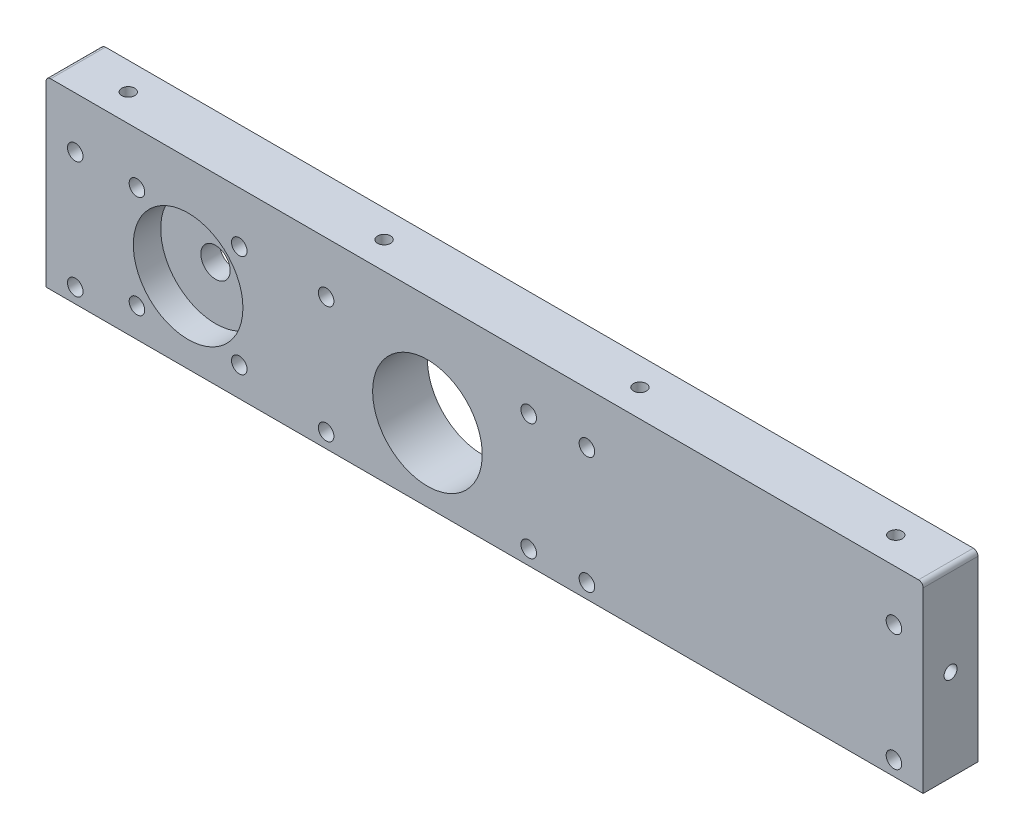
ISO-10303-21;
HEADER;
FILE_DESCRIPTION(('STEP AP214'),'2;1');
FILE_NAME('part.step','',(''),(''),'','','');
FILE_SCHEMA(('AUTOMOTIVE_DESIGN { 1 0 10303 214 1 1 1 1 }'));
ENDSEC;
DATA;
#1=APPLICATION_CONTEXT('core data for automotive mechanical design processes');
#2=APPLICATION_PROTOCOL_DEFINITION('international standard','automotive_design',2000,#1);
#3=PRODUCT_CONTEXT('',#1,'mechanical');
#4=PRODUCT('Part','Part','',(#3));
#5=PRODUCT_RELATED_PRODUCT_CATEGORY('part','',(#4));
#6=PRODUCT_DEFINITION_FORMATION('','',#4);
#7=PRODUCT_DEFINITION_CONTEXT('part definition',#1,'design');
#8=PRODUCT_DEFINITION('design','',#6,#7);
#9=PRODUCT_DEFINITION_SHAPE('','',#8);
#10=(LENGTH_UNIT() NAMED_UNIT(*) SI_UNIT(.MILLI.,.METRE.));
#11=(NAMED_UNIT(*) PLANE_ANGLE_UNIT() SI_UNIT($,.RADIAN.));
#12=(NAMED_UNIT(*) SI_UNIT($,.STERADIAN.) SOLID_ANGLE_UNIT());
#13=UNCERTAINTY_MEASURE_WITH_UNIT(LENGTH_MEASURE(1.E-05),#10,'distance_accuracy_value','');
#14=(GEOMETRIC_REPRESENTATION_CONTEXT(3) GLOBAL_UNCERTAINTY_ASSIGNED_CONTEXT((#13)) GLOBAL_UNIT_ASSIGNED_CONTEXT((#10,
#11,#12)) REPRESENTATION_CONTEXT('',''));
#15=CARTESIAN_POINT('',(0.,0.,0.));
#16=DIRECTION('',(0.,0.,1.));
#17=DIRECTION('',(1.,0.,0.));
#18=AXIS2_PLACEMENT_3D('',#15,#16,#17);
#19=CARTESIAN_POINT('',(24.6888,1.7907,4.7625));
#20=DIRECTION('',(0.,0.,-1.));
#21=DIRECTION('',(-1.,0.,0.));
#22=AXIS2_PLACEMENT_3D('',#19,#20,#21);
#23=CYLINDRICAL_SURFACE('',#22,2.5527);
#24=CARTESIAN_POINT('',(24.6888,1.7907,4.7625));
#25=DIRECTION('',(0.,0.,1.));
#26=DIRECTION('',(1.,0.,0.));
#27=AXIS2_PLACEMENT_3D('',#24,#25,#26);
#28=CIRCLE('',#27,2.5527);
#29=CARTESIAN_POINT('',(22.1361,1.7907,4.7625));
#30=VERTEX_POINT('',#29);
#31=EDGE_CURVE('E173',#30,#30,#28,.T.);
#32=CARTESIAN_POINT('',(24.6888,1.7907,1.524));
#33=DIRECTION('',(0.,0.,-1.));
#34=DIRECTION('',(-1.,0.,0.));
#35=AXIS2_PLACEMENT_3D('',#32,#33,#34);
#36=CIRCLE('',#35,2.5527);
#37=CARTESIAN_POINT('',(22.1361,1.7907,1.524));
#38=VERTEX_POINT('',#37);
#39=EDGE_CURVE('E139',#38,#38,#36,.T.);
#40=CARTESIAN_POINT('',(22.1361,1.7907,4.7625));
#41=CARTESIAN_POINT('',(22.1361,1.7907,4.728765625));
#42=CARTESIAN_POINT('',(22.1361,1.7907,4.69503125));
#43=CARTESIAN_POINT('',(22.1361,1.7907,4.6275625));
#44=CARTESIAN_POINT('',(22.1361,1.7907,4.593828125));
#45=CARTESIAN_POINT('',(22.1361,1.7907,4.526359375));
#46=CARTESIAN_POINT('',(22.1361,1.7907,4.492625));
#47=CARTESIAN_POINT('',(22.1361,1.7907,4.42515625));
#48=CARTESIAN_POINT('',(22.1361,1.7907,4.391421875));
#49=CARTESIAN_POINT('',(22.1361,1.7907,4.323953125));
#50=CARTESIAN_POINT('',(22.1361,1.7907,4.29021875));
#51=CARTESIAN_POINT('',(22.1361,1.7907,4.22275));
#52=CARTESIAN_POINT('',(22.1361,1.7907,4.189015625));
#53=CARTESIAN_POINT('',(22.1361,1.7907,4.121546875));
#54=CARTESIAN_POINT('',(22.1361,1.7907,4.0878125));
#55=CARTESIAN_POINT('',(22.1361,1.7907,4.02034375));
#56=CARTESIAN_POINT('',(22.1361,1.7907,3.986609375));
#57=CARTESIAN_POINT('',(22.1361,1.7907,3.919140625));
#58=CARTESIAN_POINT('',(22.1361,1.7907,3.88540625));
#59=CARTESIAN_POINT('',(22.1361,1.7907,3.8179375));
#60=CARTESIAN_POINT('',(22.1361,1.7907,3.784203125));
#61=CARTESIAN_POINT('',(22.1361,1.7907,3.716734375));
#62=CARTESIAN_POINT('',(22.1361,1.7907,3.683));
#63=CARTESIAN_POINT('',(22.1361,1.7907,3.61553125));
#64=CARTESIAN_POINT('',(22.1361,1.7907,3.581796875));
#65=CARTESIAN_POINT('',(22.1361,1.7907,3.514328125));
#66=CARTESIAN_POINT('',(22.1361,1.7907,3.48059375));
#67=CARTESIAN_POINT('',(22.1361,1.7907,3.413125));
#68=CARTESIAN_POINT('',(22.1361,1.7907,3.379390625));
#69=CARTESIAN_POINT('',(22.1361,1.7907,3.311921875));
#70=CARTESIAN_POINT('',(22.1361,1.7907,3.2781875));
#71=CARTESIAN_POINT('',(22.1361,1.7907,3.21071875));
#72=CARTESIAN_POINT('',(22.1361,1.7907,3.176984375));
#73=CARTESIAN_POINT('',(22.1361,1.7907,3.109515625));
#74=CARTESIAN_POINT('',(22.1361,1.7907,3.07578125));
#75=CARTESIAN_POINT('',(22.1361,1.7907,3.0083125));
#76=CARTESIAN_POINT('',(22.1361,1.7907,2.974578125));
#77=CARTESIAN_POINT('',(22.1361,1.7907,2.907109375));
#78=CARTESIAN_POINT('',(22.1361,1.7907,2.873375));
#79=CARTESIAN_POINT('',(22.1361,1.7907,2.80590625));
#80=CARTESIAN_POINT('',(22.1361,1.7907,2.772171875));
#81=CARTESIAN_POINT('',(22.1361,1.7907,2.704703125));
#82=CARTESIAN_POINT('',(22.1361,1.7907,2.67096875));
#83=CARTESIAN_POINT('',(22.1361,1.7907,2.6035));
#84=CARTESIAN_POINT('',(22.1361,1.7907,2.569765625));
#85=CARTESIAN_POINT('',(22.1361,1.7907,2.502296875));
#86=CARTESIAN_POINT('',(22.1361,1.7907,2.4685625));
#87=CARTESIAN_POINT('',(22.1361,1.7907,2.40109375));
#88=CARTESIAN_POINT('',(22.1361,1.7907,2.367359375));
#89=CARTESIAN_POINT('',(22.1361,1.7907,2.299890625));
#90=CARTESIAN_POINT('',(22.1361,1.7907,2.26615625));
#91=CARTESIAN_POINT('',(22.1361,1.7907,2.1986875));
#92=CARTESIAN_POINT('',(22.1361,1.7907,2.164953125));
#93=CARTESIAN_POINT('',(22.1361,1.7907,2.097484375));
#94=CARTESIAN_POINT('',(22.1361,1.7907,2.06375));
#95=CARTESIAN_POINT('',(22.1361,1.7907,1.99628125));
#96=CARTESIAN_POINT('',(22.1361,1.7907,1.962546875));
#97=CARTESIAN_POINT('',(22.1361,1.7907,1.895078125));
#98=CARTESIAN_POINT('',(22.1361,1.7907,1.86134375));
#99=CARTESIAN_POINT('',(22.1361,1.7907,1.793875));
#100=CARTESIAN_POINT('',(22.1361,1.7907,1.760140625));
#101=CARTESIAN_POINT('',(22.1361,1.7907,1.692671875));
#102=CARTESIAN_POINT('',(22.1361,1.7907,1.6589375));
#103=CARTESIAN_POINT('',(22.1361,1.7907,1.59146875));
#104=CARTESIAN_POINT('',(22.1361,1.7907,1.557734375));
#105=CARTESIAN_POINT('',(22.1361,1.7907,1.524));
#106=B_SPLINE_CURVE_WITH_KNOTS('',3,(#40,#41,#42,#43,#44,#45,#46,#47,#48,#49,#50,#51,#52,#53,
#54,#55,#56,#57,#58,#59,#60,#61,#62,#63,#64,#65,#66,#67,#68,#69,#70,#71,#72,#73,#74,#75,#76,#77,
#78,#79,#80,#81,#82,#83,#84,#85,#86,#87,#88,#89,#90,#91,#92,#93,#94,#95,#96,#97,#98,#99,#100,
#101,#102,#103,#104,#105),.UNSPECIFIED.,.F.,.F.,(4,2,2,2,2,2,2,2,2,2,2,2,2,2,2,2,2,2,2,2,2,2,2,
2,2,2,2,2,2,2,2,2,4),(0.,0.101203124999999,0.202406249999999,0.303609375,0.4048125,
0.506015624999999,0.607218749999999,0.708421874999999,0.809625,0.910828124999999,1.01203125,
1.113234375,1.2144375,1.315640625,1.41684375,1.518046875,1.61925,1.720453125,1.82165625,
1.922859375,2.0240625,2.125265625,2.22646875,2.327671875,2.428875,2.530078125,2.63128125,
2.732484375,2.8336875,2.934890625,3.03609375,3.137296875,3.2385),.UNSPECIFIED.);
#107=EDGE_CURVE('BSEAM29',#30,#38,#106,.T.);
#108=ORIENTED_EDGE('',*,*,#31,.T.);
#109=ORIENTED_EDGE('',*,*,#39,.T.);
#110=ORIENTED_EDGE('',*,*,#107,.T.);
#111=ORIENTED_EDGE('',*,*,#107,.F.);
#112=EDGE_LOOP('',(#108,#110,#109,#111));
#113=FACE_BOUND('',#112,.T.);
#114=ADVANCED_FACE('F29',(#113),#23,.F.);
#115=CARTESIAN_POINT('',(0.8128,19.03095,0.));
#116=DIRECTION('',(0.,0.,-1.));
#117=DIRECTION('',(-1.,0.,0.));
#118=AXIS2_PLACEMENT_3D('',#115,#116,#117);
#119=PLANE('',#118);
#120=CARTESIAN_POINT('',(93.98,-9.36625,0.));
#121=DIRECTION('',(0.,0.,1.));
#122=DIRECTION('',(1.,0.,0.));
#123=AXIS2_PLACEMENT_3D('',#120,#121,#122);
#124=CIRCLE('',#123,1.35255);
#125=CARTESIAN_POINT('',(95.33255,-9.36625,0.));
#126=VERTEX_POINT('',#125);
#127=EDGE_CURVE('E603',#126,#126,#124,.T.);
#128=ORIENTED_EDGE('',*,*,#127,.T.);
#129=EDGE_LOOP('',(#128));
#130=FACE_BOUND('',#129,.T.);
#131=CARTESIAN_POINT('',(93.98,10.95375,0.));
#132=DIRECTION('',(0.,0.,1.));
#133=DIRECTION('',(1.,0.,0.));
#134=AXIS2_PLACEMENT_3D('',#131,#132,#133);
#135=CIRCLE('',#134,1.35255);
#136=CARTESIAN_POINT('',(95.33255,10.95375,0.));
#137=VERTEX_POINT('',#136);
#138=EDGE_CURVE('E613',#137,#137,#135,.T.);
#139=ORIENTED_EDGE('',*,*,#138,.T.);
#140=EDGE_LOOP('',(#139));
#141=FACE_BOUND('',#140,.T.);
#142=CARTESIAN_POINT('',(147.32,10.95375,0.));
#143=DIRECTION('',(0.,0.,1.));
#144=DIRECTION('',(1.,0.,0.));
#145=AXIS2_PLACEMENT_3D('',#142,#143,#144);
#146=CIRCLE('',#145,1.35255);
#147=CARTESIAN_POINT('',(148.67255,10.95375,0.));
#148=VERTEX_POINT('',#147);
#149=EDGE_CURVE('E619',#148,#148,#146,.T.);
#150=ORIENTED_EDGE('',*,*,#149,.T.);
#151=EDGE_LOOP('',(#150));
#152=FACE_BOUND('',#151,.T.);
#153=CARTESIAN_POINT('',(147.32,-9.36625,0.));
#154=DIRECTION('',(0.,0.,1.));
#155=DIRECTION('',(1.,0.,0.));
#156=AXIS2_PLACEMENT_3D('',#153,#154,#155);
#157=CIRCLE('',#156,1.35255);
#158=CARTESIAN_POINT('',(148.67255,-9.36625,0.));
#159=VERTEX_POINT('',#158);
#160=EDGE_CURVE('E625',#159,#159,#157,.T.);
#161=ORIENTED_EDGE('',*,*,#160,.T.);
#162=EDGE_LOOP('',(#161));
#163=FACE_BOUND('',#162,.T.);
#164=CARTESIAN_POINT('',(5.08,-9.36625,0.));
#165=DIRECTION('',(0.,0.,1.));
#166=DIRECTION('',(1.,0.,0.));
#167=AXIS2_PLACEMENT_3D('',#164,#165,#166);
#168=CIRCLE('',#167,1.35255);
#169=CARTESIAN_POINT('',(6.43255,-9.36625,0.));
#170=VERTEX_POINT('',#169);
#171=EDGE_CURVE('E631',#170,#170,#168,.T.);
#172=ORIENTED_EDGE('',*,*,#171,.T.);
#173=EDGE_LOOP('',(#172));
#174=FACE_BOUND('',#173,.T.);
#175=CARTESIAN_POINT('',(5.08,10.95375,0.));
#176=DIRECTION('',(0.,0.,1.));
#177=DIRECTION('',(1.,0.,0.));
#178=AXIS2_PLACEMENT_3D('',#175,#176,#177);
#179=CIRCLE('',#178,1.35255);
#180=CARTESIAN_POINT('',(6.43255,10.95375,0.));
#181=VERTEX_POINT('',#180);
#182=EDGE_CURVE('E637',#181,#181,#179,.T.);
#183=ORIENTED_EDGE('',*,*,#182,.T.);
#184=EDGE_LOOP('',(#183));
#185=FACE_BOUND('',#184,.T.);
#186=CARTESIAN_POINT('',(15.7988,-6.8199,0.));
#187=DIRECTION('',(0.,0.,1.));
#188=DIRECTION('',(1.,0.,0.));
#189=AXIS2_PLACEMENT_3D('',#186,#187,#188);
#190=CIRCLE('',#189,1.35255);
#191=CARTESIAN_POINT('',(17.15135,-6.8199,0.));
#192=VERTEX_POINT('',#191);
#193=EDGE_CURVE('E643',#192,#192,#190,.T.);
#194=ORIENTED_EDGE('',*,*,#193,.T.);
#195=EDGE_LOOP('',(#194));
#196=FACE_BOUND('',#195,.T.);
#197=CARTESIAN_POINT('',(33.5788,-6.8199,0.));
#198=DIRECTION('',(0.,0.,1.));
#199=DIRECTION('',(1.,0.,0.));
#200=AXIS2_PLACEMENT_3D('',#197,#198,#199);
#201=CIRCLE('',#200,1.35255000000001);
#202=CARTESIAN_POINT('',(34.93135,-6.8199,0.));
#203=VERTEX_POINT('',#202);
#204=EDGE_CURVE('E649',#203,#203,#201,.T.);
#205=ORIENTED_EDGE('',*,*,#204,.T.);
#206=EDGE_LOOP('',(#205));
#207=FACE_BOUND('',#206,.T.);
#208=CARTESIAN_POINT('',(33.5788,10.9601,0.));
#209=DIRECTION('',(0.,0.,1.));
#210=DIRECTION('',(1.,0.,0.));
#211=AXIS2_PLACEMENT_3D('',#208,#209,#210);
#212=CIRCLE('',#211,1.35255);
#213=CARTESIAN_POINT('',(34.93135,10.9601,0.));
#214=VERTEX_POINT('',#213);
#215=EDGE_CURVE('E655',#214,#214,#212,.T.);
#216=ORIENTED_EDGE('',*,*,#215,.T.);
#217=EDGE_LOOP('',(#216));
#218=FACE_BOUND('',#217,.T.);
#219=CARTESIAN_POINT('',(15.7988,10.9601,0.));
#220=DIRECTION('',(0.,0.,1.));
#221=DIRECTION('',(1.,0.,0.));
#222=AXIS2_PLACEMENT_3D('',#219,#220,#221);
#223=CIRCLE('',#222,1.35255000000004);
#224=CARTESIAN_POINT('',(17.15135,10.9601,0.));
#225=VERTEX_POINT('',#224);
#226=EDGE_CURVE('E661',#225,#225,#223,.T.);
#227=ORIENTED_EDGE('',*,*,#226,.T.);
#228=EDGE_LOOP('',(#227));
#229=FACE_BOUND('',#228,.T.);
#230=CARTESIAN_POINT('',(24.6888,1.7907,0.));
#231=DIRECTION('',(0.,0.,-1.));
#232=DIRECTION('',(-1.,0.,0.));
#233=AXIS2_PLACEMENT_3D('',#230,#231,#232);
#234=CIRCLE('',#233,4.7625);
#235=CARTESIAN_POINT('',(19.9263,1.7907,0.));
#236=VERTEX_POINT('',#235);
#237=EDGE_CURVE('E163',#236,#236,#234,.T.);
#238=ORIENTED_EDGE('',*,*,#237,.F.);
#239=EDGE_LOOP('',(#238));
#240=FACE_BOUND('',#239,.T.);
#241=CARTESIAN_POINT('',(83.8662362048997,-9.36625000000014,0.));
#242=DIRECTION('',(0.,0.,1.));
#243=DIRECTION('',(1.,0.,0.));
#244=AXIS2_PLACEMENT_3D('',#241,#242,#243);
#245=CIRCLE('',#244,1.35255);
#246=CARTESIAN_POINT('',(85.2187862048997,-9.36625000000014,0.));
#247=VERTEX_POINT('',#246);
#248=EDGE_CURVE('E392',#247,#247,#245,.T.);
#249=ORIENTED_EDGE('',*,*,#248,.T.);
#250=EDGE_LOOP('',(#249));
#251=FACE_BOUND('',#250,.T.);
#252=CARTESIAN_POINT('',(83.8662362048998,10.9537499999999,0.));
#253=DIRECTION('',(0.,0.,1.));
#254=DIRECTION('',(1.,0.,0.));
#255=AXIS2_PLACEMENT_3D('',#252,#253,#254);
#256=CIRCLE('',#255,1.35255);
#257=CARTESIAN_POINT('',(85.2187862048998,10.9537499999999,0.));
#258=VERTEX_POINT('',#257);
#259=EDGE_CURVE('E387',#258,#258,#256,.T.);
#260=ORIENTED_EDGE('',*,*,#259,.T.);
#261=EDGE_LOOP('',(#260));
#262=FACE_BOUND('',#261,.T.);
#263=CARTESIAN_POINT('',(48.6709637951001,10.95375,0.));
#264=DIRECTION('',(0.,0.,1.));
#265=DIRECTION('',(1.,0.,0.));
#266=AXIS2_PLACEMENT_3D('',#263,#264,#265);
#267=CIRCLE('',#266,1.35255);
#268=CARTESIAN_POINT('',(50.0235137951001,10.95375,0.));
#269=VERTEX_POINT('',#268);
#270=EDGE_CURVE('E381',#269,#269,#267,.T.);
#271=ORIENTED_EDGE('',*,*,#270,.T.);
#272=EDGE_LOOP('',(#271));
#273=FACE_BOUND('',#272,.T.);
#274=CARTESIAN_POINT('',(48.6709637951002,-9.36625000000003,0.));
#275=DIRECTION('',(0.,0.,1.));
#276=DIRECTION('',(1.,0.,0.));
#277=AXIS2_PLACEMENT_3D('',#274,#275,#276);
#278=CIRCLE('',#277,1.35255);
#279=CARTESIAN_POINT('',(50.0235137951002,-9.36625000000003,0.));
#280=VERTEX_POINT('',#279);
#281=EDGE_CURVE('E375',#280,#280,#278,.T.);
#282=ORIENTED_EDGE('',*,*,#281,.T.);
#283=EDGE_LOOP('',(#282));
#284=FACE_BOUND('',#283,.T.);
#285=DIRECTION('',(0.,-1.,0.));
#286=VECTOR('',#285,1.);
#287=CARTESIAN_POINT('',(0.,-11.90625,0.));
#288=LINE('',#287,#286);
#289=CARTESIAN_POINT('',(0.,19.03095,0.));
#290=VERTEX_POINT('',#289);
#291=CARTESIAN_POINT('',(0.,-11.90625,0.));
#292=VERTEX_POINT('',#291);
#293=EDGE_CURVE('E311',#290,#292,#288,.T.);
#294=ORIENTED_EDGE('',*,*,#293,.F.);
#295=CARTESIAN_POINT('',(0.8128,19.03095,0.));
#296=DIRECTION('',(0.,0.,1.));
#297=DIRECTION('',(-1.,0.,0.));
#298=AXIS2_PLACEMENT_3D('',#295,#296,#297);
#299=CIRCLE('',#298,0.8128);
#300=CARTESIAN_POINT('',(0.812800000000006,19.84375,0.));
#301=VERTEX_POINT('',#300);
#302=EDGE_CURVE('E328',#301,#290,#299,.T.);
#303=ORIENTED_EDGE('',*,*,#302,.F.);
#304=DIRECTION('',(-1.,0.,0.));
#305=VECTOR('',#304,1.);
#306=CARTESIAN_POINT('',(0.812800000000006,19.84375,0.));
#307=LINE('',#306,#305);
#308=CARTESIAN_POINT('',(151.5872,19.84375,0.));
#309=VERTEX_POINT('',#308);
#310=EDGE_CURVE('E323',#309,#301,#307,.T.);
#311=ORIENTED_EDGE('',*,*,#310,.F.);
#312=CARTESIAN_POINT('',(151.5872,19.03095,0.));
#313=DIRECTION('',(0.,0.,1.));
#314=DIRECTION('',(-1.,0.,0.));
#315=AXIS2_PLACEMENT_3D('',#312,#313,#314);
#316=CIRCLE('',#315,0.812800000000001);
#317=CARTESIAN_POINT('',(152.4,19.03095,0.));
#318=VERTEX_POINT('',#317);
#319=EDGE_CURVE('E321',#318,#309,#316,.T.);
#320=ORIENTED_EDGE('',*,*,#319,.F.);
#321=DIRECTION('',(0.,1.,0.));
#322=VECTOR('',#321,1.);
#323=CARTESIAN_POINT('',(152.4,-11.90625,0.));
#324=LINE('',#323,#322);
#325=CARTESIAN_POINT('',(152.4,-11.90625,0.));
#326=VERTEX_POINT('',#325);
#327=EDGE_CURVE('E310',#326,#318,#324,.T.);
#328=ORIENTED_EDGE('',*,*,#327,.F.);
#329=DIRECTION('',(1.,0.,0.));
#330=VECTOR('',#329,1.);
#331=CARTESIAN_POINT('',(0.,-11.90625,0.));
#332=LINE('',#331,#330);
#333=EDGE_CURVE('E302',#292,#326,#332,.T.);
#334=ORIENTED_EDGE('',*,*,#333,.F.);
#335=EDGE_LOOP('',(#294,#303,#311,#320,#328,#334));
#336=FACE_BOUND('',#335,.T.);
#337=CARTESIAN_POINT('',(66.2686,0.793750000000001,0.));
#338=DIRECTION('',(0.,0.,-1.));
#339=DIRECTION('',(-1.,0.,0.));
#340=AXIS2_PLACEMENT_3D('',#337,#338,#339);
#341=CIRCLE('',#340,9.525);
#342=CARTESIAN_POINT('',(56.7436,0.793750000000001,0.));
#343=VERTEX_POINT('',#342);
#344=EDGE_CURVE('E355',#343,#343,#341,.T.);
#345=ORIENTED_EDGE('',*,*,#344,.F.);
#346=EDGE_LOOP('',(#345));
#347=FACE_BOUND('',#346,.T.);
#348=ADVANCED_FACE('F246',(#130,#141,#152,#163,#174,#185,#196,#207,#218,#229,#240,#251,#262,
#273,#284,#336,#347),#119,.T.);
#349=CARTESIAN_POINT('',(0.,-11.90625,9.525));
#350=DIRECTION('',(1.,0.,0.));
#351=DIRECTION('',(0.,0.,-1.));
#352=AXIS2_PLACEMENT_3D('',#349,#350,#351);
#353=PLANE('',#352);
#354=CARTESIAN_POINT('',(0.,3.96875,4.7625));
#355=DIRECTION('',(-1.,0.,0.));
#356=DIRECTION('',(0.,0.,1.));
#357=AXIS2_PLACEMENT_3D('',#354,#355,#356);
#358=CIRCLE('',#357,1.1303);
#359=CARTESIAN_POINT('',(0.,3.96875,5.8928));
#360=VERTEX_POINT('',#359);
#361=EDGE_CURVE('E176',#360,#360,#358,.T.);
#362=ORIENTED_EDGE('',*,*,#361,.F.);
#363=EDGE_LOOP('',(#362));
#364=FACE_BOUND('',#363,.T.);
#365=ORIENTED_EDGE('',*,*,#293,.T.);
#366=DIRECTION('',(0.,0.,-1.));
#367=VECTOR('',#366,1.);
#368=CARTESIAN_POINT('',(0.,-11.90625,9.525));
#369=LINE('',#368,#367);
#370=CARTESIAN_POINT('',(0.,-11.90625,9.525));
#371=VERTEX_POINT('',#370);
#372=EDGE_CURVE('E129',#371,#292,#369,.T.);
#373=ORIENTED_EDGE('',*,*,#372,.F.);
#374=DIRECTION('',(0.,-1.,0.));
#375=VECTOR('',#374,1.);
#376=CARTESIAN_POINT('',(0.,-11.90625,9.525));
#377=LINE('',#376,#375);
#378=CARTESIAN_POINT('',(0.,19.03095,9.525));
#379=VERTEX_POINT('',#378);
#380=EDGE_CURVE('E330',#379,#371,#377,.T.);
#381=ORIENTED_EDGE('',*,*,#380,.F.);
#382=DIRECTION('',(0.,0.,-1.));
#383=VECTOR('',#382,1.);
#384=CARTESIAN_POINT('',(0.,19.03095,9.525));
#385=LINE('',#384,#383);
#386=EDGE_CURVE('E339',#379,#290,#385,.T.);
#387=ORIENTED_EDGE('',*,*,#386,.T.);
#388=EDGE_LOOP('',(#365,#373,#381,#387));
#389=FACE_BOUND('',#388,.T.);
#390=ADVANCED_FACE('F31',(#364,#389),#353,.F.);
#391=CARTESIAN_POINT('',(0.,-11.90625,9.525));
#392=DIRECTION('',(0.,1.,0.));
#393=DIRECTION('',(0.,0.,1.));
#394=AXIS2_PLACEMENT_3D('',#391,#392,#393);
#395=PLANE('',#394);
#396=CARTESIAN_POINT('',(142.875,-11.90625,4.7625));
#397=DIRECTION('',(0.,-1.,0.));
#398=DIRECTION('',(0.,0.,-1.));
#399=AXIS2_PLACEMENT_3D('',#396,#397,#398);
#400=CIRCLE('',#399,2.01930000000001);
#401=CARTESIAN_POINT('',(142.875,-11.90625,2.74319999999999));
#402=VERTEX_POINT('',#401);
#403=EDGE_CURVE('E288',#402,#402,#400,.T.);
#404=ORIENTED_EDGE('',*,*,#403,.F.);
#405=EDGE_LOOP('',(#404));
#406=FACE_BOUND('',#405,.T.);
#407=CARTESIAN_POINT('',(98.425,-11.90625,4.7625));
#408=DIRECTION('',(0.,-1.,0.));
#409=DIRECTION('',(0.,0.,-1.));
#410=AXIS2_PLACEMENT_3D('',#407,#408,#409);
#411=CIRCLE('',#410,2.01929999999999);
#412=CARTESIAN_POINT('',(98.425,-11.90625,2.74320000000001));
#413=VERTEX_POINT('',#412);
#414=EDGE_CURVE('E292',#413,#413,#411,.T.);
#415=ORIENTED_EDGE('',*,*,#414,.F.);
#416=EDGE_LOOP('',(#415));
#417=FACE_BOUND('',#416,.T.);
#418=CARTESIAN_POINT('',(53.975,-11.90625,4.7625));
#419=DIRECTION('',(0.,-1.,0.));
#420=DIRECTION('',(0.,0.,-1.));
#421=AXIS2_PLACEMENT_3D('',#418,#419,#420);
#422=CIRCLE('',#421,2.01930000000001);
#423=CARTESIAN_POINT('',(53.975,-11.90625,2.74319999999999));
#424=VERTEX_POINT('',#423);
#425=EDGE_CURVE('E296',#424,#424,#422,.T.);
#426=ORIENTED_EDGE('',*,*,#425,.F.);
#427=EDGE_LOOP('',(#426));
#428=FACE_BOUND('',#427,.T.);
#429=CARTESIAN_POINT('',(9.525,-11.90625,4.7625));
#430=DIRECTION('',(0.,-1.,0.));
#431=DIRECTION('',(0.,0.,-1.));
#432=AXIS2_PLACEMENT_3D('',#429,#430,#431);
#433=CIRCLE('',#432,2.0193);
#434=CARTESIAN_POINT('',(9.525,-11.90625,2.7432));
#435=VERTEX_POINT('',#434);
#436=EDGE_CURVE('E300',#435,#435,#433,.T.);
#437=ORIENTED_EDGE('',*,*,#436,.F.);
#438=EDGE_LOOP('',(#437));
#439=FACE_BOUND('',#438,.T.);
#440=ORIENTED_EDGE('',*,*,#333,.T.);
#441=DIRECTION('',(0.,0.,-1.));
#442=VECTOR('',#441,1.);
#443=CARTESIAN_POINT('',(152.4,-11.90625,9.525));
#444=LINE('',#443,#442);
#445=CARTESIAN_POINT('',(152.4,-11.90625,9.525));
#446=VERTEX_POINT('',#445);
#447=EDGE_CURVE('E133',#446,#326,#444,.T.);
#448=ORIENTED_EDGE('',*,*,#447,.F.);
#449=DIRECTION('',(1.,0.,0.));
#450=VECTOR('',#449,1.);
#451=CARTESIAN_POINT('',(0.,-11.90625,9.525));
#452=LINE('',#451,#450);
#453=EDGE_CURVE('E332',#371,#446,#452,.T.);
#454=ORIENTED_EDGE('',*,*,#453,.F.);
#455=ORIENTED_EDGE('',*,*,#372,.T.);
#456=EDGE_LOOP('',(#440,#448,#454,#455));
#457=FACE_BOUND('',#456,.T.);
#458=ADVANCED_FACE('F277',(#406,#417,#428,#439,#457),#395,.F.);
#459=CARTESIAN_POINT('',(152.4,-11.90625,9.525));
#460=DIRECTION('',(-1.,0.,0.));
#461=DIRECTION('',(0.,0.,1.));
#462=AXIS2_PLACEMENT_3D('',#459,#460,#461);
#463=PLANE('',#462);
#464=CARTESIAN_POINT('',(152.4,3.96875,4.7625));
#465=DIRECTION('',(1.,0.,0.));
#466=DIRECTION('',(0.,0.,-1.));
#467=AXIS2_PLACEMENT_3D('',#464,#465,#466);
#468=CIRCLE('',#467,1.1303);
#469=CARTESIAN_POINT('',(152.4,3.96875,3.6322));
#470=VERTEX_POINT('',#469);
#471=EDGE_CURVE('E187',#470,#470,#468,.T.);
#472=ORIENTED_EDGE('',*,*,#471,.F.);
#473=EDGE_LOOP('',(#472));
#474=FACE_BOUND('',#473,.T.);
#475=ORIENTED_EDGE('',*,*,#327,.T.);
#476=DIRECTION('',(0.,0.,-1.));
#477=VECTOR('',#476,1.);
#478=CARTESIAN_POINT('',(152.4,19.03095,9.525));
#479=LINE('',#478,#477);
#480=CARTESIAN_POINT('',(152.4,19.03095,9.525));
#481=VERTEX_POINT('',#480);
#482=EDGE_CURVE('E317',#481,#318,#479,.T.);
#483=ORIENTED_EDGE('',*,*,#482,.F.);
#484=DIRECTION('',(0.,1.,0.));
#485=VECTOR('',#484,1.);
#486=CARTESIAN_POINT('',(152.4,-11.90625,9.525));
#487=LINE('',#486,#485);
#488=EDGE_CURVE('E316',#446,#481,#487,.T.);
#489=ORIENTED_EDGE('',*,*,#488,.F.);
#490=ORIENTED_EDGE('',*,*,#447,.T.);
#491=EDGE_LOOP('',(#475,#483,#489,#490));
#492=FACE_BOUND('',#491,.T.);
#493=ADVANCED_FACE('F274',(#474,#492),#463,.F.);
#494=CARTESIAN_POINT('',(151.5872,19.03095,9.525));
#495=DIRECTION('',(0.,0.,-1.));
#496=DIRECTION('',(-1.,0.,0.));
#497=AXIS2_PLACEMENT_3D('',#494,#495,#496);
#498=CYLINDRICAL_SURFACE('',#497,0.812800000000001);
#499=ORIENTED_EDGE('',*,*,#319,.T.);
#500=DIRECTION('',(0.,0.,-1.));
#501=VECTOR('',#500,1.);
#502=CARTESIAN_POINT('',(151.5872,19.84375,9.525));
#503=LINE('',#502,#501);
#504=CARTESIAN_POINT('',(151.5872,19.84375,9.525));
#505=VERTEX_POINT('',#504);
#506=EDGE_CURVE('E345',#505,#309,#503,.T.);
#507=ORIENTED_EDGE('',*,*,#506,.F.);
#508=CARTESIAN_POINT('',(151.5872,19.03095,9.525));
#509=DIRECTION('',(0.,0.,1.));
#510=DIRECTION('',(-1.,0.,0.));
#511=AXIS2_PLACEMENT_3D('',#508,#509,#510);
#512=CIRCLE('',#511,0.812800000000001);
#513=EDGE_CURVE('E335',#481,#505,#512,.T.);
#514=ORIENTED_EDGE('',*,*,#513,.F.);
#515=ORIENTED_EDGE('',*,*,#482,.T.);
#516=EDGE_LOOP('',(#499,#507,#514,#515));
#517=FACE_BOUND('',#516,.T.);
#518=ADVANCED_FACE('F270',(#517),#498,.T.);
#519=CARTESIAN_POINT('',(0.812800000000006,19.84375,9.525));
#520=DIRECTION('',(0.,-1.,0.));
#521=DIRECTION('',(0.,0.,-1.));
#522=AXIS2_PLACEMENT_3D('',#519,#520,#521);
#523=PLANE('',#522);
#524=CARTESIAN_POINT('',(142.875,19.84375,4.76249999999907));
#525=DIRECTION('',(0.,1.,0.));
#526=DIRECTION('',(0.,0.,1.));
#527=AXIS2_PLACEMENT_3D('',#524,#525,#526);
#528=CIRCLE('',#527,1.13030000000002);
#529=CARTESIAN_POINT('',(142.875,19.84375,5.89279999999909));
#530=VERTEX_POINT('',#529);
#531=EDGE_CURVE('E114',#530,#530,#528,.T.);
#532=ORIENTED_EDGE('',*,*,#531,.F.);
#533=EDGE_LOOP('',(#532));
#534=FACE_BOUND('',#533,.T.);
#535=CARTESIAN_POINT('',(98.425,19.84375,4.76249999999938));
#536=DIRECTION('',(0.,1.,0.));
#537=DIRECTION('',(0.,0.,1.));
#538=AXIS2_PLACEMENT_3D('',#535,#536,#537);
#539=CIRCLE('',#538,1.1303);
#540=CARTESIAN_POINT('',(98.425,19.84375,5.89279999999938));
#541=VERTEX_POINT('',#540);
#542=EDGE_CURVE('E123',#541,#541,#539,.T.);
#543=ORIENTED_EDGE('',*,*,#542,.F.);
#544=EDGE_LOOP('',(#543));
#545=FACE_BOUND('',#544,.T.);
#546=CARTESIAN_POINT('',(53.975,19.84375,4.76249999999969));
#547=DIRECTION('',(0.,1.,0.));
#548=DIRECTION('',(0.,0.,1.));
#549=AXIS2_PLACEMENT_3D('',#546,#547,#548);
#550=CIRCLE('',#549,1.1303);
#551=CARTESIAN_POINT('',(53.975,19.84375,5.89279999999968));
#552=VERTEX_POINT('',#551);
#553=EDGE_CURVE('E146',#552,#552,#550,.T.);
#554=ORIENTED_EDGE('',*,*,#553,.F.);
#555=EDGE_LOOP('',(#554));
#556=FACE_BOUND('',#555,.T.);
#557=CARTESIAN_POINT('',(9.525,19.84375,4.7625));
#558=DIRECTION('',(0.,1.,0.));
#559=DIRECTION('',(0.,0.,1.));
#560=AXIS2_PLACEMENT_3D('',#557,#558,#559);
#561=CIRCLE('',#560,1.1303);
#562=CARTESIAN_POINT('',(9.525,19.84375,5.8928));
#563=VERTEX_POINT('',#562);
#564=EDGE_CURVE('E145',#563,#563,#561,.T.);
#565=ORIENTED_EDGE('',*,*,#564,.F.);
#566=EDGE_LOOP('',(#565));
#567=FACE_BOUND('',#566,.T.);
#568=ORIENTED_EDGE('',*,*,#310,.T.);
#569=DIRECTION('',(0.,0.,-1.));
#570=VECTOR('',#569,1.);
#571=CARTESIAN_POINT('',(0.812800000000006,19.84375,9.525));
#572=LINE('',#571,#570);
#573=CARTESIAN_POINT('',(0.812800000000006,19.84375,9.525));
#574=VERTEX_POINT('',#573);
#575=EDGE_CURVE('E342',#574,#301,#572,.T.);
#576=ORIENTED_EDGE('',*,*,#575,.F.);
#577=DIRECTION('',(-1.,0.,0.));
#578=VECTOR('',#577,1.);
#579=CARTESIAN_POINT('',(0.812800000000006,19.84375,9.525));
#580=LINE('',#579,#578);
#581=EDGE_CURVE('E51',#505,#574,#580,.T.);
#582=ORIENTED_EDGE('',*,*,#581,.F.);
#583=ORIENTED_EDGE('',*,*,#506,.T.);
#584=EDGE_LOOP('',(#568,#576,#582,#583));
#585=FACE_BOUND('',#584,.T.);
#586=ADVANCED_FACE('F267',(#534,#545,#556,#567,#585),#523,.F.);
#587=CARTESIAN_POINT('',(0.8128,19.03095,9.525));
#588=DIRECTION('',(0.,0.,-1.));
#589=DIRECTION('',(-1.,0.,0.));
#590=AXIS2_PLACEMENT_3D('',#587,#588,#589);
#591=CYLINDRICAL_SURFACE('',#590,0.8128);
#592=ORIENTED_EDGE('',*,*,#302,.T.);
#593=ORIENTED_EDGE('',*,*,#386,.F.);
#594=CARTESIAN_POINT('',(0.8128,19.03095,9.525));
#595=DIRECTION('',(0.,0.,1.));
#596=DIRECTION('',(-1.,0.,0.));
#597=AXIS2_PLACEMENT_3D('',#594,#595,#596);
#598=CIRCLE('',#597,0.8128);
#599=EDGE_CURVE('E46',#574,#379,#598,.T.);
#600=ORIENTED_EDGE('',*,*,#599,.F.);
#601=ORIENTED_EDGE('',*,*,#575,.T.);
#602=EDGE_LOOP('',(#592,#593,#600,#601));
#603=FACE_BOUND('',#602,.T.);
#604=ADVANCED_FACE('F263',(#603),#591,.T.);
#605=CARTESIAN_POINT('',(0.8128,19.03095,9.525));
#606=DIRECTION('',(0.,0.,-1.));
#607=DIRECTION('',(-1.,0.,0.));
#608=AXIS2_PLACEMENT_3D('',#605,#606,#607);
#609=PLANE('',#608);
#610=CARTESIAN_POINT('',(93.98,-9.36625,9.525));
#611=DIRECTION('',(0.,0.,1.));
#612=DIRECTION('',(1.,0.,0.));
#613=AXIS2_PLACEMENT_3D('',#610,#611,#612);
#614=CIRCLE('',#613,1.35255);
#615=CARTESIAN_POINT('',(95.33255,-9.36625,9.525));
#616=VERTEX_POINT('',#615);
#617=EDGE_CURVE('E606',#616,#616,#614,.T.);
#618=ORIENTED_EDGE('',*,*,#617,.F.);
#619=EDGE_LOOP('',(#618));
#620=FACE_BOUND('',#619,.T.);
#621=CARTESIAN_POINT('',(93.98,10.95375,9.525));
#622=DIRECTION('',(0.,0.,1.));
#623=DIRECTION('',(1.,0.,0.));
#624=AXIS2_PLACEMENT_3D('',#621,#622,#623);
#625=CIRCLE('',#624,1.35255);
#626=CARTESIAN_POINT('',(95.33255,10.95375,9.525));
#627=VERTEX_POINT('',#626);
#628=EDGE_CURVE('E608',#627,#627,#625,.T.);
#629=ORIENTED_EDGE('',*,*,#628,.F.);
#630=EDGE_LOOP('',(#629));
#631=FACE_BOUND('',#630,.T.);
#632=CARTESIAN_POINT('',(147.32,10.95375,9.525));
#633=DIRECTION('',(0.,0.,1.));
#634=DIRECTION('',(1.,0.,0.));
#635=AXIS2_PLACEMENT_3D('',#632,#633,#634);
#636=CIRCLE('',#635,1.35255);
#637=CARTESIAN_POINT('',(148.67255,10.95375,9.525));
#638=VERTEX_POINT('',#637);
#639=EDGE_CURVE('E616',#638,#638,#636,.T.);
#640=ORIENTED_EDGE('',*,*,#639,.F.);
#641=EDGE_LOOP('',(#640));
#642=FACE_BOUND('',#641,.T.);
#643=CARTESIAN_POINT('',(147.32,-9.36625,9.525));
#644=DIRECTION('',(0.,0.,1.));
#645=DIRECTION('',(1.,0.,0.));
#646=AXIS2_PLACEMENT_3D('',#643,#644,#645);
#647=CIRCLE('',#646,1.35255);
#648=CARTESIAN_POINT('',(148.67255,-9.36625,9.525));
#649=VERTEX_POINT('',#648);
#650=EDGE_CURVE('E622',#649,#649,#647,.T.);
#651=ORIENTED_EDGE('',*,*,#650,.F.);
#652=EDGE_LOOP('',(#651));
#653=FACE_BOUND('',#652,.T.);
#654=CARTESIAN_POINT('',(5.08,-9.36625,9.525));
#655=DIRECTION('',(0.,0.,1.));
#656=DIRECTION('',(1.,0.,0.));
#657=AXIS2_PLACEMENT_3D('',#654,#655,#656);
#658=CIRCLE('',#657,1.35255);
#659=CARTESIAN_POINT('',(6.43255,-9.36625,9.525));
#660=VERTEX_POINT('',#659);
#661=EDGE_CURVE('E628',#660,#660,#658,.T.);
#662=ORIENTED_EDGE('',*,*,#661,.F.);
#663=EDGE_LOOP('',(#662));
#664=FACE_BOUND('',#663,.T.);
#665=CARTESIAN_POINT('',(5.08,10.95375,9.525));
#666=DIRECTION('',(0.,0.,1.));
#667=DIRECTION('',(1.,0.,0.));
#668=AXIS2_PLACEMENT_3D('',#665,#666,#667);
#669=CIRCLE('',#668,1.35255);
#670=CARTESIAN_POINT('',(6.43255,10.95375,9.525));
#671=VERTEX_POINT('',#670);
#672=EDGE_CURVE('E634',#671,#671,#669,.T.);
#673=ORIENTED_EDGE('',*,*,#672,.F.);
#674=EDGE_LOOP('',(#673));
#675=FACE_BOUND('',#674,.T.);
#676=CARTESIAN_POINT('',(15.7988,-6.8199,9.525));
#677=DIRECTION('',(0.,0.,1.));
#678=DIRECTION('',(1.,0.,0.));
#679=AXIS2_PLACEMENT_3D('',#676,#677,#678);
#680=CIRCLE('',#679,1.35255);
#681=CARTESIAN_POINT('',(17.15135,-6.8199,9.525));
#682=VERTEX_POINT('',#681);
#683=EDGE_CURVE('E640',#682,#682,#680,.T.);
#684=ORIENTED_EDGE('',*,*,#683,.F.);
#685=EDGE_LOOP('',(#684));
#686=FACE_BOUND('',#685,.T.);
#687=CARTESIAN_POINT('',(33.5788,-6.8199,9.525));
#688=DIRECTION('',(0.,0.,1.));
#689=DIRECTION('',(1.,0.,0.));
#690=AXIS2_PLACEMENT_3D('',#687,#688,#689);
#691=CIRCLE('',#690,1.35255000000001);
#692=CARTESIAN_POINT('',(34.93135,-6.8199,9.525));
#693=VERTEX_POINT('',#692);
#694=EDGE_CURVE('E646',#693,#693,#691,.T.);
#695=ORIENTED_EDGE('',*,*,#694,.F.);
#696=EDGE_LOOP('',(#695));
#697=FACE_BOUND('',#696,.T.);
#698=CARTESIAN_POINT('',(33.5788,10.9601,9.525));
#699=DIRECTION('',(0.,0.,1.));
#700=DIRECTION('',(1.,0.,0.));
#701=AXIS2_PLACEMENT_3D('',#698,#699,#700);
#702=CIRCLE('',#701,1.35255);
#703=CARTESIAN_POINT('',(34.93135,10.9601,9.525));
#704=VERTEX_POINT('',#703);
#705=EDGE_CURVE('E652',#704,#704,#702,.T.);
#706=ORIENTED_EDGE('',*,*,#705,.F.);
#707=EDGE_LOOP('',(#706));
#708=FACE_BOUND('',#707,.T.);
#709=CARTESIAN_POINT('',(15.7988,10.9601,9.525));
#710=DIRECTION('',(0.,0.,1.));
#711=DIRECTION('',(1.,0.,0.));
#712=AXIS2_PLACEMENT_3D('',#709,#710,#711);
#713=CIRCLE('',#712,1.35255000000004);
#714=CARTESIAN_POINT('',(17.15135,10.9601,9.525));
#715=VERTEX_POINT('',#714);
#716=EDGE_CURVE('E658',#715,#715,#713,.T.);
#717=ORIENTED_EDGE('',*,*,#716,.F.);
#718=EDGE_LOOP('',(#717));
#719=FACE_BOUND('',#718,.T.);
#720=CARTESIAN_POINT('',(24.6888,2.0701,9.525));
#721=DIRECTION('',(0.,0.,1.));
#722=DIRECTION('',(1.,0.,0.));
#723=AXIS2_PLACEMENT_3D('',#720,#721,#722);
#724=CIRCLE('',#723,9.525);
#725=CARTESIAN_POINT('',(34.2138,2.0701,9.525));
#726=VERTEX_POINT('',#725);
#727=EDGE_CURVE('E141',#726,#726,#724,.T.);
#728=ORIENTED_EDGE('',*,*,#727,.F.);
#729=EDGE_LOOP('',(#728));
#730=FACE_BOUND('',#729,.T.);
#731=CARTESIAN_POINT('',(83.8662362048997,-9.36625000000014,9.525));
#732=DIRECTION('',(0.,0.,1.));
#733=DIRECTION('',(1.,0.,0.));
#734=AXIS2_PLACEMENT_3D('',#731,#732,#733);
#735=CIRCLE('',#734,1.35255);
#736=CARTESIAN_POINT('',(85.2187862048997,-9.36625000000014,9.525));
#737=VERTEX_POINT('',#736);
#738=EDGE_CURVE('E211',#737,#737,#735,.T.);
#739=ORIENTED_EDGE('',*,*,#738,.F.);
#740=EDGE_LOOP('',(#739));
#741=FACE_BOUND('',#740,.T.);
#742=CARTESIAN_POINT('',(83.8662362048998,10.9537499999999,9.525));
#743=DIRECTION('',(0.,0.,1.));
#744=DIRECTION('',(1.,0.,0.));
#745=AXIS2_PLACEMENT_3D('',#742,#743,#744);
#746=CIRCLE('',#745,1.35255);
#747=CARTESIAN_POINT('',(85.2187862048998,10.9537499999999,9.525));
#748=VERTEX_POINT('',#747);
#749=EDGE_CURVE('E390',#748,#748,#746,.T.);
#750=ORIENTED_EDGE('',*,*,#749,.F.);
#751=EDGE_LOOP('',(#750));
#752=FACE_BOUND('',#751,.T.);
#753=CARTESIAN_POINT('',(48.6709637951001,10.95375,9.525));
#754=DIRECTION('',(0.,0.,1.));
#755=DIRECTION('',(1.,0.,0.));
#756=AXIS2_PLACEMENT_3D('',#753,#754,#755);
#757=CIRCLE('',#756,1.35255);
#758=CARTESIAN_POINT('',(50.0235137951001,10.95375,9.525));
#759=VERTEX_POINT('',#758);
#760=EDGE_CURVE('E384',#759,#759,#757,.T.);
#761=ORIENTED_EDGE('',*,*,#760,.F.);
#762=EDGE_LOOP('',(#761));
#763=FACE_BOUND('',#762,.T.);
#764=CARTESIAN_POINT('',(48.6709637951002,-9.36625000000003,9.525));
#765=DIRECTION('',(0.,0.,1.));
#766=DIRECTION('',(1.,0.,0.));
#767=AXIS2_PLACEMENT_3D('',#764,#765,#766);
#768=CIRCLE('',#767,1.35255);
#769=CARTESIAN_POINT('',(50.0235137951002,-9.36625000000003,9.525));
#770=VERTEX_POINT('',#769);
#771=EDGE_CURVE('E378',#770,#770,#768,.T.);
#772=ORIENTED_EDGE('',*,*,#771,.F.);
#773=EDGE_LOOP('',(#772));
#774=FACE_BOUND('',#773,.T.);
#775=CARTESIAN_POINT('',(66.2686,0.793750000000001,9.525));
#776=DIRECTION('',(0.,0.,-1.));
#777=DIRECTION('',(-1.,0.,0.));
#778=AXIS2_PLACEMENT_3D('',#775,#776,#777);
#779=CIRCLE('',#778,9.525);
#780=CARTESIAN_POINT('',(56.7436,0.793750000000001,9.525));
#781=VERTEX_POINT('',#780);
#782=EDGE_CURVE('E353',#781,#781,#779,.T.);
#783=ORIENTED_EDGE('',*,*,#782,.T.);
#784=EDGE_LOOP('',(#783));
#785=FACE_BOUND('',#784,.T.);
#786=ORIENTED_EDGE('',*,*,#380,.T.);
#787=ORIENTED_EDGE('',*,*,#453,.T.);
#788=ORIENTED_EDGE('',*,*,#488,.T.);
#789=ORIENTED_EDGE('',*,*,#513,.T.);
#790=ORIENTED_EDGE('',*,*,#581,.T.);
#791=ORIENTED_EDGE('',*,*,#599,.T.);
#792=EDGE_LOOP('',(#786,#787,#788,#789,#790,#791));
#793=FACE_BOUND('',#792,.T.);
#794=ADVANCED_FACE('F258',(#620,#631,#642,#653,#664,#675,#686,#697,#708,#719,#730,#741,#752,
#763,#774,#785,#793),#609,.F.);
#795=CARTESIAN_POINT('',(66.2686,0.793750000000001,9.525));
#796=DIRECTION('',(0.,0.,-1.));
#797=DIRECTION('',(-1.,0.,0.));
#798=AXIS2_PLACEMENT_3D('',#795,#796,#797);
#799=CYLINDRICAL_SURFACE('',#798,9.525);
#800=CARTESIAN_POINT('',(56.7436,0.793750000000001,9.525));
#801=CARTESIAN_POINT('',(56.7436,0.793750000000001,9.42578125));
#802=CARTESIAN_POINT('',(56.7436,0.793750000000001,9.3265625));
#803=CARTESIAN_POINT('',(56.7436,0.793750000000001,9.128125));
#804=CARTESIAN_POINT('',(56.7436,0.793750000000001,9.02890625));
#805=CARTESIAN_POINT('',(56.7436,0.793750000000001,8.83046875));
#806=CARTESIAN_POINT('',(56.7436,0.793750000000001,8.73125));
#807=CARTESIAN_POINT('',(56.7436,0.793750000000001,8.5328125));
#808=CARTESIAN_POINT('',(56.7436,0.793750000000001,8.43359375));
#809=CARTESIAN_POINT('',(56.7436,0.793750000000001,8.23515625));
#810=CARTESIAN_POINT('',(56.7436,0.793750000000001,8.1359375));
#811=CARTESIAN_POINT('',(56.7436,0.793750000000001,7.9375));
#812=CARTESIAN_POINT('',(56.7436,0.793750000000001,7.83828125));
#813=CARTESIAN_POINT('',(56.7436,0.793750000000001,7.63984375));
#814=CARTESIAN_POINT('',(56.7436,0.793750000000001,7.540625));
#815=CARTESIAN_POINT('',(56.7436,0.793750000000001,7.3421875));
#816=CARTESIAN_POINT('',(56.7436,0.793750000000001,7.24296875));
#817=CARTESIAN_POINT('',(56.7436,0.793750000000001,7.04453125));
#818=CARTESIAN_POINT('',(56.7436,0.793750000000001,6.9453125));
#819=CARTESIAN_POINT('',(56.7436,0.793750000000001,6.746875));
#820=CARTESIAN_POINT('',(56.7436,0.793750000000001,6.64765625));
#821=CARTESIAN_POINT('',(56.7436,0.793750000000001,6.44921875));
#822=CARTESIAN_POINT('',(56.7436,0.793750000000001,6.35));
#823=CARTESIAN_POINT('',(56.7436,0.793750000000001,6.1515625));
#824=CARTESIAN_POINT('',(56.7436,0.793750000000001,6.05234375));
#825=CARTESIAN_POINT('',(56.7436,0.793750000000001,5.85390625));
#826=CARTESIAN_POINT('',(56.7436,0.793750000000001,5.7546875));
#827=CARTESIAN_POINT('',(56.7436,0.793750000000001,5.55625));
#828=CARTESIAN_POINT('',(56.7436,0.793750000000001,5.45703125));
#829=CARTESIAN_POINT('',(56.7436,0.793750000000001,5.25859375));
#830=CARTESIAN_POINT('',(56.7436,0.793750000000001,5.159375));
#831=CARTESIAN_POINT('',(56.7436,0.793750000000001,4.9609375));
#832=CARTESIAN_POINT('',(56.7436,0.793750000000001,4.86171875));
#833=CARTESIAN_POINT('',(56.7436,0.793750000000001,4.66328125));
#834=CARTESIAN_POINT('',(56.7436,0.793750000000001,4.5640625));
#835=CARTESIAN_POINT('',(56.7436,0.793750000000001,4.365625));
#836=CARTESIAN_POINT('',(56.7436,0.793750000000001,4.26640625));
#837=CARTESIAN_POINT('',(56.7436,0.793750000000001,4.06796875));
#838=CARTESIAN_POINT('',(56.7436,0.793750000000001,3.96875));
#839=CARTESIAN_POINT('',(56.7436,0.793750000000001,3.7703125));
#840=CARTESIAN_POINT('',(56.7436,0.793750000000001,3.67109375));
#841=CARTESIAN_POINT('',(56.7436,0.793750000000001,3.47265625));
#842=CARTESIAN_POINT('',(56.7436,0.793750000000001,3.3734375));
#843=CARTESIAN_POINT('',(56.7436,0.793750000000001,3.175));
#844=CARTESIAN_POINT('',(56.7436,0.793750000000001,3.07578125));
#845=CARTESIAN_POINT('',(56.7436,0.793750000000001,2.87734375));
#846=CARTESIAN_POINT('',(56.7436,0.793750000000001,2.778125));
#847=CARTESIAN_POINT('',(56.7436,0.793750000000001,2.5796875));
#848=CARTESIAN_POINT('',(56.7436,0.793750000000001,2.48046875));
#849=CARTESIAN_POINT('',(56.7436,0.793750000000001,2.28203125));
#850=CARTESIAN_POINT('',(56.7436,0.793750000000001,2.1828125));
#851=CARTESIAN_POINT('',(56.7436,0.793750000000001,1.984375));
#852=CARTESIAN_POINT('',(56.7436,0.793750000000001,1.88515625));
#853=CARTESIAN_POINT('',(56.7436,0.793750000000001,1.68671875));
#854=CARTESIAN_POINT('',(56.7436,0.793750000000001,1.5875));
#855=CARTESIAN_POINT('',(56.7436,0.793750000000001,1.3890625));
#856=CARTESIAN_POINT('',(56.7436,0.793750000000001,1.28984375));
#857=CARTESIAN_POINT('',(56.7436,0.793750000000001,1.09140625));
#858=CARTESIAN_POINT('',(56.7436,0.793750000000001,0.992187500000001));
#859=CARTESIAN_POINT('',(56.7436,0.793750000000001,0.793750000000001));
#860=CARTESIAN_POINT('',(56.7436,0.793750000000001,0.69453125));
#861=CARTESIAN_POINT('',(56.7436,0.793750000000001,0.49609375));
#862=CARTESIAN_POINT('',(56.7436,0.793750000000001,0.396875));
#863=CARTESIAN_POINT('',(56.7436,0.793750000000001,0.1984375));
#864=CARTESIAN_POINT('',(56.7436,0.793750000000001,0.0992187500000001));
#865=CARTESIAN_POINT('',(56.7436,0.793750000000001,0.));
#866=B_SPLINE_CURVE_WITH_KNOTS('',3,(#800,#801,#802,#803,#804,#805,#806,#807,#808,#809,#810,
#811,#812,#813,#814,#815,#816,#817,#818,#819,#820,#821,#822,#823,#824,#825,#826,#827,#828,#829,
#830,#831,#832,#833,#834,#835,#836,#837,#838,#839,#840,#841,#842,#843,#844,#845,#846,#847,#848,
#849,#850,#851,#852,#853,#854,#855,#856,#857,#858,#859,#860,#861,#862,#863,#864,#865),
.UNSPECIFIED.,.F.,.F.,(4,2,2,2,2,2,2,2,2,2,2,2,2,2,2,2,2,2,2,2,2,2,2,2,2,2,2,2,2,2,2,2,4),(0.,
0.29765625,0.5953125,0.892968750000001,1.190625,1.48828125,1.7859375,2.08359375,2.38125,
2.67890625,2.9765625,3.27421875,3.571875,3.86953125,4.1671875,4.46484375,4.7625,5.06015625,
5.3578125,5.65546875,5.953125,6.25078125,6.5484375,6.84609375,7.14375,7.44140625,7.7390625,
8.03671875,8.334375,8.63203125,8.9296875,9.22734375,9.525),.UNSPECIFIED.);
#867=EDGE_CURVE('BSEAM242',#781,#343,#866,.T.);
#868=ORIENTED_EDGE('',*,*,#782,.F.);
#869=ORIENTED_EDGE('',*,*,#344,.T.);
#870=ORIENTED_EDGE('',*,*,#867,.T.);
#871=ORIENTED_EDGE('',*,*,#867,.F.);
#872=EDGE_LOOP('',(#868,#870,#869,#871));
#873=FACE_BOUND('',#872,.T.);
#874=ADVANCED_FACE('F242',(#873),#799,.F.);
#875=CARTESIAN_POINT('',(9.525,3.96875,4.7625));
#876=DIRECTION('',(0.,-1.,0.));
#877=DIRECTION('',(0.,0.,-1.));
#878=AXIS2_PLACEMENT_3D('',#875,#876,#877);
#879=CYLINDRICAL_SURFACE('',#878,2.0193);
#880=CARTESIAN_POINT('',(9.525,3.96875,4.7625));
#881=DIRECTION('',(0.,-1.,0.));
#882=DIRECTION('',(0.,0.,-1.));
#883=AXIS2_PLACEMENT_3D('',#880,#881,#882);
#884=CIRCLE('',#883,2.0193);
#885=CARTESIAN_POINT('',(7.85168162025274,3.96875,3.6322));
#886=VERTEX_POINT('',#885);
#887=CARTESIAN_POINT('',(7.85168162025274,3.96875,5.8928));
#888=VERTEX_POINT('',#887);
#889=EDGE_CURVE('E360',#886,#888,#884,.T.);
#890=ORIENTED_EDGE('',*,*,#889,.F.);
#891=CARTESIAN_POINT('',(7.85168162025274,3.96875,3.6322));
#892=CARTESIAN_POINT('',(7.85168902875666,3.93972152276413,3.63219714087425));
#893=CARTESIAN_POINT('',(7.85092533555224,3.91071061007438,3.63331898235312));
#894=CARTESIAN_POINT('',(7.84792639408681,3.85295865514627,3.63777435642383));
#895=CARTESIAN_POINT('',(7.8456923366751,3.82421741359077,3.64110609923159));
#896=CARTESIAN_POINT('',(7.83693466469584,3.73912782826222,3.65429293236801));
#897=CARTESIAN_POINT('',(7.82835329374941,3.68345060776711,3.66734100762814));
#898=CARTESIAN_POINT('',(7.80694437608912,3.57565841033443,3.70125040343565));
#899=CARTESIAN_POINT('',(7.79412887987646,3.52353382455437,3.72208957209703));
#900=CARTESIAN_POINT('',(7.76572528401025,3.42344087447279,3.7708740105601));
#901=CARTESIAN_POINT('',(7.75013175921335,3.37548092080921,3.79883323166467));
#902=CARTESIAN_POINT('',(7.71597181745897,3.27969450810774,3.86445000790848));
#903=CARTESIAN_POINT('',(7.69726493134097,3.2324025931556,3.90281452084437));
#904=CARTESIAN_POINT('',(7.66011648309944,3.14450315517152,3.98668618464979));
#905=CARTESIAN_POINT('',(7.64167500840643,3.10389779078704,4.03219563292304));
#906=CARTESIAN_POINT('',(7.60515286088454,3.02690651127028,4.13405764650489));
#907=CARTESIAN_POINT('',(7.58725409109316,2.99122942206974,4.1910175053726));
#908=CARTESIAN_POINT('',(7.555770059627,2.93021435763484,4.31132434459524));
#909=CARTESIAN_POINT('',(7.54218150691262,2.90486848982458,4.37466640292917));
#910=CARTESIAN_POINT('',(7.52188660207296,2.86752699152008,4.50020353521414));
#911=CARTESIAN_POINT('',(7.51469083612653,2.85457456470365,4.56203294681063));
#912=CARTESIAN_POINT('',(7.50612371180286,2.83918797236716,4.68736848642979));
#913=CARTESIAN_POINT('',(7.50474781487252,2.83674561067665,4.75087326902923));
#914=CARTESIAN_POINT('',(7.50779329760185,2.84219344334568,4.8703569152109));
#915=CARTESIAN_POINT('',(7.51160269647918,2.84899278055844,4.92640568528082));
#916=CARTESIAN_POINT('',(7.5235989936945,2.87070924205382,5.03641218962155));
#917=CARTESIAN_POINT('',(7.53178616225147,2.88562686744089,5.09036979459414));
#918=CARTESIAN_POINT('',(7.55191645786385,2.92313235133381,5.19540310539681));
#919=CARTESIAN_POINT('',(7.56389618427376,2.94579512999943,5.24644475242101));
#920=CARTESIAN_POINT('',(7.59060416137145,2.99797972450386,5.34409379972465));
#921=CARTESIAN_POINT('',(7.60533325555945,3.02750364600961,5.39069983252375));
#922=CARTESIAN_POINT('',(7.63814939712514,3.09626898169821,5.4836488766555));
#923=CARTESIAN_POINT('',(7.65642761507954,3.13622257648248,5.5293974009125));
#924=CARTESIAN_POINT('',(7.6933878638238,3.22286433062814,5.61391174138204));
#925=CARTESIAN_POINT('',(7.7120703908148,3.26956121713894,5.65266836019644));
#926=CARTESIAN_POINT('',(7.74972030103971,3.3736098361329,5.72572243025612));
#927=CARTESIAN_POINT('',(7.7685498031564,3.43155026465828,5.75925979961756));
#928=CARTESIAN_POINT('',(7.80188442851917,3.55337402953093,5.81584068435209));
#929=CARTESIAN_POINT('',(7.81640246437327,3.61723885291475,5.83891564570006));
#930=CARTESIAN_POINT('',(7.83523617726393,3.7292621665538,5.86816104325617));
#931=CARTESIAN_POINT('',(7.84130815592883,3.77635046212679,5.87733065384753));
#932=CARTESIAN_POINT('',(7.8495737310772,3.87184439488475,5.88968074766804));
#933=CARTESIAN_POINT('',(7.85174995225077,3.92025496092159,5.89283440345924));
#934=CARTESIAN_POINT('',(7.85168162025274,3.96875,5.8928));
#935=B_SPLINE_CURVE_WITH_KNOTS('',3,(#891,#892,#893,#894,#895,#896,#897,#898,#899,#900,#901,
#902,#903,#904,#905,#906,#907,#908,#909,#910,#911,#912,#913,#914,#915,#916,#917,#918,#919,#920,
#921,#922,#923,#924,#925,#926,#927,#928,#929,#930,#931,#932,#933,#934),.UNSPECIFIED.,.F.,.F.,(4,
2,2,2,2,2,2,2,2,2,2,2,2,2,2,2,2,2,2,2,2,4),(0.,0.087020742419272,0.173971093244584,
0.346503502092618,0.518549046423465,0.690934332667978,0.88128049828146,1.07168799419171,
1.27923500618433,1.48662316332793,1.67626500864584,1.86575893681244,2.03472124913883,
2.20369399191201,2.37434980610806,2.54505806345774,2.73457053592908,2.92433051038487,
3.1319031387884,3.33884767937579,3.48339664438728,3.62858871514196),.UNSPECIFIED.);
#936=EDGE_CURVE('E179',#886,#888,#935,.T.);
#937=ORIENTED_EDGE('',*,*,#936,.T.);
#938=EDGE_LOOP('',(#890,#937));
#939=FACE_BOUND('',#938,.T.);
#940=ORIENTED_EDGE('',*,*,#436,.T.);
#941=EDGE_LOOP('',(#940));
#942=FACE_BOUND('',#941,.T.);
#943=ADVANCED_FACE('F189',(#939,#942),#879,.F.);
#944=CARTESIAN_POINT('',(9.525,3.96875,4.7625));
#945=DIRECTION('',(0.,-1.,0.));
#946=DIRECTION('',(0.,0.,-1.));
#947=AXIS2_PLACEMENT_3D('',#944,#945,#946);
#948=PLANE('',#947);
#949=CARTESIAN_POINT('',(9.525,3.96875,4.7625));
#950=DIRECTION('',(0.,-1.,0.));
#951=DIRECTION('',(0.,0.,-1.));
#952=AXIS2_PLACEMENT_3D('',#949,#950,#951);
#953=CIRCLE('',#952,1.1303);
#954=CARTESIAN_POINT('',(9.525,3.96875,3.6322));
#955=VERTEX_POINT('',#954);
#956=CARTESIAN_POINT('',(9.525,3.96875,5.8928));
#957=VERTEX_POINT('',#956);
#958=EDGE_CURVE('E161',#955,#957,#953,.T.);
#959=ORIENTED_EDGE('',*,*,#958,.F.);
#960=DIRECTION('',(-1.,0.,0.));
#961=VECTOR('',#960,1.);
#962=CARTESIAN_POINT('',(9.525,3.96875,3.6322));
#963=LINE('',#962,#961);
#964=EDGE_CURVE('E38',#886,#955,#963,.F.);
#965=ORIENTED_EDGE('',*,*,#964,.F.);
#966=ORIENTED_EDGE('',*,*,#889,.T.);
#967=DIRECTION('',(-1.,0.,0.));
#968=VECTOR('',#967,1.);
#969=CARTESIAN_POINT('',(9.525,3.96875,5.8928));
#970=LINE('',#969,#968);
#971=EDGE_CURVE('E11',#957,#888,#970,.T.);
#972=ORIENTED_EDGE('',*,*,#971,.F.);
#973=EDGE_LOOP('',(#959,#965,#966,#972));
#974=FACE_BOUND('',#973,.T.);
#975=ADVANCED_FACE('F234',(#974),#948,.T.);
#976=CARTESIAN_POINT('',(53.975,3.96875,4.7625));
#977=DIRECTION('',(0.,-1.,0.));
#978=DIRECTION('',(0.,0.,-1.));
#979=AXIS2_PLACEMENT_3D('',#976,#977,#978);
#980=CYLINDRICAL_SURFACE('',#979,2.01930000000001);
#981=CARTESIAN_POINT('',(53.975,3.96875,4.7625));
#982=DIRECTION('',(0.,-1.,0.));
#983=DIRECTION('',(0.,0.,-1.));
#984=AXIS2_PLACEMENT_3D('',#981,#982,#983);
#985=CIRCLE('',#984,2.01930000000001);
#986=CARTESIAN_POINT('',(53.975,3.96875,2.74319999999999));
#987=VERTEX_POINT('',#986);
#988=EDGE_CURVE('E364',#987,#987,#985,.T.);
#989=ORIENTED_EDGE('',*,*,#988,.F.);
#990=EDGE_LOOP('',(#989));
#991=FACE_BOUND('',#990,.T.);
#992=ORIENTED_EDGE('',*,*,#425,.T.);
#993=EDGE_LOOP('',(#992));
#994=FACE_BOUND('',#993,.T.);
#995=ADVANCED_FACE('F231',(#991,#994),#980,.F.);
#996=CARTESIAN_POINT('',(53.975,3.96875,4.7625));
#997=DIRECTION('',(0.,-1.,0.));
#998=DIRECTION('',(0.,0.,-1.));
#999=AXIS2_PLACEMENT_3D('',#996,#997,#998);
#1000=PLANE('',#999);
#1001=CARTESIAN_POINT('',(53.975,3.96875,4.76249999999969));
#1002=DIRECTION('',(0.,-1.,0.));
#1003=DIRECTION('',(0.,0.,-1.));
#1004=AXIS2_PLACEMENT_3D('',#1001,#1002,#1003);
#1005=CIRCLE('',#1004,1.1303);
#1006=CARTESIAN_POINT('',(53.975,3.96875,3.63219999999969));
#1007=VERTEX_POINT('',#1006);
#1008=EDGE_CURVE('E143',#1007,#1007,#1005,.T.);
#1009=ORIENTED_EDGE('',*,*,#1008,.F.);
#1010=EDGE_LOOP('',(#1009));
#1011=FACE_BOUND('',#1010,.T.);
#1012=ORIENTED_EDGE('',*,*,#988,.T.);
#1013=EDGE_LOOP('',(#1012));
#1014=FACE_BOUND('',#1013,.T.);
#1015=ADVANCED_FACE('F227',(#1011,#1014),#1000,.T.);
#1016=CARTESIAN_POINT('',(98.425,3.96875,4.7625));
#1017=DIRECTION('',(0.,-1.,0.));
#1018=DIRECTION('',(0.,0.,-1.));
#1019=AXIS2_PLACEMENT_3D('',#1016,#1017,#1018);
#1020=CYLINDRICAL_SURFACE('',#1019,2.01929999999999);
#1021=CARTESIAN_POINT('',(98.425,3.96875,4.7625));
#1022=DIRECTION('',(0.,-1.,0.));
#1023=DIRECTION('',(0.,0.,-1.));
#1024=AXIS2_PLACEMENT_3D('',#1021,#1022,#1023);
#1025=CIRCLE('',#1024,2.01929999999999);
#1026=CARTESIAN_POINT('',(98.425,3.96875,2.74320000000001));
#1027=VERTEX_POINT('',#1026);
#1028=EDGE_CURVE('E368',#1027,#1027,#1025,.T.);
#1029=ORIENTED_EDGE('',*,*,#1028,.F.);
#1030=EDGE_LOOP('',(#1029));
#1031=FACE_BOUND('',#1030,.T.);
#1032=ORIENTED_EDGE('',*,*,#414,.T.);
#1033=EDGE_LOOP('',(#1032));
#1034=FACE_BOUND('',#1033,.T.);
#1035=ADVANCED_FACE('F223',(#1031,#1034),#1020,.F.);
#1036=CARTESIAN_POINT('',(98.425,3.96875,4.7625));
#1037=DIRECTION('',(0.,-1.,0.));
#1038=DIRECTION('',(0.,0.,-1.));
#1039=AXIS2_PLACEMENT_3D('',#1036,#1037,#1038);
#1040=PLANE('',#1039);
#1041=CARTESIAN_POINT('',(98.425,3.96875,4.76249999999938));
#1042=DIRECTION('',(0.,-1.,0.));
#1043=DIRECTION('',(0.,0.,-1.));
#1044=AXIS2_PLACEMENT_3D('',#1041,#1042,#1043);
#1045=CIRCLE('',#1044,1.1303);
#1046=CARTESIAN_POINT('',(98.425,3.96875,3.63219999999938));
#1047=VERTEX_POINT('',#1046);
#1048=EDGE_CURVE('E33',#1047,#1047,#1045,.T.);
#1049=ORIENTED_EDGE('',*,*,#1048,.F.);
#1050=EDGE_LOOP('',(#1049));
#1051=FACE_BOUND('',#1050,.T.);
#1052=ORIENTED_EDGE('',*,*,#1028,.T.);
#1053=EDGE_LOOP('',(#1052));
#1054=FACE_BOUND('',#1053,.T.);
#1055=ADVANCED_FACE('F218',(#1051,#1054),#1040,.T.);
#1056=CARTESIAN_POINT('',(142.875,3.96875,4.7625));
#1057=DIRECTION('',(0.,-1.,0.));
#1058=DIRECTION('',(0.,0.,-1.));
#1059=AXIS2_PLACEMENT_3D('',#1056,#1057,#1058);
#1060=CYLINDRICAL_SURFACE('',#1059,2.01930000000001);
#1061=CARTESIAN_POINT('',(142.875,3.96875,4.7625));
#1062=DIRECTION('',(0.,-1.,0.));
#1063=DIRECTION('',(0.,0.,-1.));
#1064=AXIS2_PLACEMENT_3D('',#1061,#1062,#1063);
#1065=CIRCLE('',#1064,2.01930000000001);
#1066=CARTESIAN_POINT('',(144.548318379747,3.96875,5.8928));
#1067=VERTEX_POINT('',#1066);
#1068=CARTESIAN_POINT('',(144.548318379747,3.96875,3.6322));
#1069=VERTEX_POINT('',#1068);
#1070=EDGE_CURVE('E372',#1067,#1069,#1065,.T.);
#1071=ORIENTED_EDGE('',*,*,#1070,.F.);
#1072=CARTESIAN_POINT('',(144.548318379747,3.96875,5.8928));
#1073=CARTESIAN_POINT('',(144.548310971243,3.93972152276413,5.89280285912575));
#1074=CARTESIAN_POINT('',(144.549074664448,3.91071061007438,5.89168101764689));
#1075=CARTESIAN_POINT('',(144.552073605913,3.85295865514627,5.88722564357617));
#1076=CARTESIAN_POINT('',(144.554307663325,3.82421741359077,5.88389390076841));
#1077=CARTESIAN_POINT('',(144.563065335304,3.73912782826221,5.87070706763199));
#1078=CARTESIAN_POINT('',(144.571646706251,3.68345060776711,5.85765899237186));
#1079=CARTESIAN_POINT('',(144.593055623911,3.57565841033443,5.82374959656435));
#1080=CARTESIAN_POINT('',(144.605871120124,3.52353382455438,5.80291042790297));
#1081=CARTESIAN_POINT('',(144.63427471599,3.42344087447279,5.7541259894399));
#1082=CARTESIAN_POINT('',(144.649868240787,3.37548092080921,5.72616676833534));
#1083=CARTESIAN_POINT('',(144.684028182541,3.27969450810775,5.66054999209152));
#1084=CARTESIAN_POINT('',(144.702735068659,3.23240259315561,5.62218547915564));
#1085=CARTESIAN_POINT('',(144.739883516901,3.14450315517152,5.53831381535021));
#1086=CARTESIAN_POINT('',(144.758324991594,3.10389779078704,5.49280436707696));
#1087=CARTESIAN_POINT('',(144.794847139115,3.02690651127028,5.39094235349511));
#1088=CARTESIAN_POINT('',(144.812745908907,2.99122942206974,5.3339824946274));
#1089=CARTESIAN_POINT('',(144.844229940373,2.93021435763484,5.21367565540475));
#1090=CARTESIAN_POINT('',(144.857818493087,2.90486848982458,5.15033359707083));
#1091=CARTESIAN_POINT('',(144.878113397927,2.86752699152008,5.02479646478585));
#1092=CARTESIAN_POINT('',(144.885309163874,2.85457456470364,4.96296705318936));
#1093=CARTESIAN_POINT('',(144.893876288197,2.83918797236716,4.83763151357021));
#1094=CARTESIAN_POINT('',(144.895252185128,2.83674561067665,4.77412673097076));
#1095=CARTESIAN_POINT('',(144.892206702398,2.84219344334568,4.65464308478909));
#1096=CARTESIAN_POINT('',(144.888397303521,2.84899278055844,4.59859431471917));
#1097=CARTESIAN_POINT('',(144.876401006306,2.87070924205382,4.48858781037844));
#1098=CARTESIAN_POINT('',(144.868213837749,2.88562686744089,4.43463020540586));
#1099=CARTESIAN_POINT('',(144.848083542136,2.92313235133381,4.32959689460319));
#1100=CARTESIAN_POINT('',(144.836103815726,2.94579512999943,4.278555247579));
#1101=CARTESIAN_POINT('',(144.809395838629,2.99797972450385,4.18090620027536));
#1102=CARTESIAN_POINT('',(144.794666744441,3.02750364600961,4.13430016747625));
#1103=CARTESIAN_POINT('',(144.761850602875,3.09626898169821,4.0413511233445));
#1104=CARTESIAN_POINT('',(144.74357238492,3.13622257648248,3.99560259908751));
#1105=CARTESIAN_POINT('',(144.706612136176,3.22286433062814,3.91108825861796));
#1106=CARTESIAN_POINT('',(144.687929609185,3.26956121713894,3.87233163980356));
#1107=CARTESIAN_POINT('',(144.65027969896,3.3736098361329,3.79927756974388));
#1108=CARTESIAN_POINT('',(144.631450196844,3.43155026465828,3.76574020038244));
#1109=CARTESIAN_POINT('',(144.598115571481,3.55337402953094,3.70915931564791));
#1110=CARTESIAN_POINT('',(144.583597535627,3.61723885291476,3.68608435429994));
#1111=CARTESIAN_POINT('',(144.564763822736,3.72926216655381,3.65683895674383));
#1112=CARTESIAN_POINT('',(144.558691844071,3.7763504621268,3.64766934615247));
#1113=CARTESIAN_POINT('',(144.550426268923,3.87184439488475,3.63531925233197));
#1114=CARTESIAN_POINT('',(144.548250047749,3.92025496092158,3.63216559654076));
#1115=CARTESIAN_POINT('',(144.548318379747,3.96875,3.6322));
#1116=B_SPLINE_CURVE_WITH_KNOTS('',3,(#1072,#1073,#1074,#1075,#1076,#1077,#1078,#1079,#1080,
#1081,#1082,#1083,#1084,#1085,#1086,#1087,#1088,#1089,#1090,#1091,#1092,#1093,#1094,#1095,#1096,
#1097,#1098,#1099,#1100,#1101,#1102,#1103,#1104,#1105,#1106,#1107,#1108,#1109,#1110,#1111,#1112,
#1113,#1114,#1115),.UNSPECIFIED.,.F.,.F.,(4,2,2,2,2,2,2,2,2,2,2,2,2,2,2,2,2,2,2,2,2,4),(0.,
0.0870207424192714,0.173971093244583,0.346503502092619,0.51854904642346,0.690934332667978,
0.881280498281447,1.07168799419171,1.27923500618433,1.48662316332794,1.67626500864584,
1.86575893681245,2.03472124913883,2.20369399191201,2.37434980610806,2.54505806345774,
2.73457053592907,2.92433051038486,3.13190313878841,3.3388476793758,3.48339664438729,
3.62858871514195),.UNSPECIFIED.);
#1117=EDGE_CURVE('E128',#1067,#1069,#1116,.T.);
#1118=ORIENTED_EDGE('',*,*,#1117,.T.);
#1119=EDGE_LOOP('',(#1071,#1118));
#1120=FACE_BOUND('',#1119,.T.);
#1121=ORIENTED_EDGE('',*,*,#403,.T.);
#1122=EDGE_LOOP('',(#1121));
#1123=FACE_BOUND('',#1122,.T.);
#1124=ADVANCED_FACE('F213',(#1120,#1123),#1060,.F.);
#1125=CARTESIAN_POINT('',(142.875,3.96875,4.7625));
#1126=DIRECTION('',(0.,-1.,0.));
#1127=DIRECTION('',(0.,0.,-1.));
#1128=AXIS2_PLACEMENT_3D('',#1125,#1126,#1127);
#1129=PLANE('',#1128);
#1130=CARTESIAN_POINT('',(142.875,3.96875,4.76249999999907));
#1131=DIRECTION('',(0.,-1.,0.));
#1132=DIRECTION('',(0.,0.,-1.));
#1133=AXIS2_PLACEMENT_3D('',#1130,#1131,#1132);
#1134=CIRCLE('',#1133,1.13030000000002);
#1135=CARTESIAN_POINT('',(142.875,3.96875,5.89279999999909));
#1136=VERTEX_POINT('',#1135);
#1137=CARTESIAN_POINT('',(142.875,3.96875,3.6322));
#1138=VERTEX_POINT('',#1137);
#1139=EDGE_CURVE('E110',#1136,#1138,#1134,.T.);
#1140=ORIENTED_EDGE('',*,*,#1139,.F.);
#1141=DIRECTION('',(1.,0.,0.));
#1142=VECTOR('',#1141,1.);
#1143=CARTESIAN_POINT('',(142.875,3.96875,5.8928));
#1144=LINE('',#1143,#1142);
#1145=EDGE_CURVE('E120',#1067,#1136,#1144,.F.);
#1146=ORIENTED_EDGE('',*,*,#1145,.F.);
#1147=ORIENTED_EDGE('',*,*,#1070,.T.);
#1148=DIRECTION('',(1.,0.,0.));
#1149=VECTOR('',#1148,1.);
#1150=CARTESIAN_POINT('',(142.875,3.96875,3.6322));
#1151=LINE('',#1150,#1149);
#1152=EDGE_CURVE('E122',#1138,#1069,#1151,.T.);
#1153=ORIENTED_EDGE('',*,*,#1152,.F.);
#1154=EDGE_LOOP('',(#1140,#1146,#1147,#1153));
#1155=FACE_BOUND('',#1154,.T.);
#1156=ADVANCED_FACE('F118',(#1155),#1129,.T.);
#1157=CARTESIAN_POINT('',(48.6709637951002,-9.36625000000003,0.));
#1158=DIRECTION('',(0.,0.,1.));
#1159=DIRECTION('',(1.,0.,0.));
#1160=AXIS2_PLACEMENT_3D('',#1157,#1158,#1159);
#1161=CYLINDRICAL_SURFACE('',#1160,1.35255);
#1162=ORIENTED_EDGE('',*,*,#281,.F.);
#1163=EDGE_LOOP('',(#1162));
#1164=FACE_BOUND('',#1163,.T.);
#1165=ORIENTED_EDGE('',*,*,#771,.T.);
#1166=EDGE_LOOP('',(#1165));
#1167=FACE_BOUND('',#1166,.T.);
#1168=ADVANCED_FACE('F411',(#1164,#1167),#1161,.F.);
#1169=CARTESIAN_POINT('',(48.6709637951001,10.95375,0.));
#1170=DIRECTION('',(0.,0.,1.));
#1171=DIRECTION('',(1.,0.,0.));
#1172=AXIS2_PLACEMENT_3D('',#1169,#1170,#1171);
#1173=CYLINDRICAL_SURFACE('',#1172,1.35255);
#1174=ORIENTED_EDGE('',*,*,#270,.F.);
#1175=EDGE_LOOP('',(#1174));
#1176=FACE_BOUND('',#1175,.T.);
#1177=ORIENTED_EDGE('',*,*,#760,.T.);
#1178=EDGE_LOOP('',(#1177));
#1179=FACE_BOUND('',#1178,.T.);
#1180=ADVANCED_FACE('F413',(#1176,#1179),#1173,.F.);
#1181=CARTESIAN_POINT('',(83.8662362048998,10.9537499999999,0.));
#1182=DIRECTION('',(0.,0.,1.));
#1183=DIRECTION('',(1.,0.,0.));
#1184=AXIS2_PLACEMENT_3D('',#1181,#1182,#1183);
#1185=CYLINDRICAL_SURFACE('',#1184,1.35255);
#1186=ORIENTED_EDGE('',*,*,#259,.F.);
#1187=EDGE_LOOP('',(#1186));
#1188=FACE_BOUND('',#1187,.T.);
#1189=ORIENTED_EDGE('',*,*,#749,.T.);
#1190=EDGE_LOOP('',(#1189));
#1191=FACE_BOUND('',#1190,.T.);
#1192=ADVANCED_FACE('F418',(#1188,#1191),#1185,.F.);
#1193=CARTESIAN_POINT('',(83.8662362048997,-9.36625000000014,0.));
#1194=DIRECTION('',(0.,0.,1.));
#1195=DIRECTION('',(1.,0.,0.));
#1196=AXIS2_PLACEMENT_3D('',#1193,#1194,#1195);
#1197=CYLINDRICAL_SURFACE('',#1196,1.35255);
#1198=ORIENTED_EDGE('',*,*,#248,.F.);
#1199=EDGE_LOOP('',(#1198));
#1200=FACE_BOUND('',#1199,.T.);
#1201=ORIENTED_EDGE('',*,*,#738,.T.);
#1202=EDGE_LOOP('',(#1201));
#1203=FACE_BOUND('',#1202,.T.);
#1204=ADVANCED_FACE('F204',(#1200,#1203),#1197,.F.);
#1205=CARTESIAN_POINT('',(142.875,3.96875,4.7625));
#1206=DIRECTION('',(1.,0.,0.));
#1207=DIRECTION('',(0.,0.,-1.));
#1208=AXIS2_PLACEMENT_3D('',#1205,#1206,#1207);
#1209=CYLINDRICAL_SURFACE('',#1208,1.1303);
#1210=ORIENTED_EDGE('',*,*,#1145,.T.);
#1211=CARTESIAN_POINT('',(142.875,3.96875,4.76249999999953));
#1212=DIRECTION('',(0.707106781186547,-0.707106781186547,0.));
#1213=DIRECTION('',(0.707106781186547,0.707106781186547,0.));
#1214=AXIS2_PLACEMENT_3D('',#1211,#1212,#1213);
#1215=ELLIPSE('',#1214,1.59848558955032,1.13030000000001);
#1216=EDGE_CURVE('E106',#1136,#1138,#1215,.F.);
#1217=ORIENTED_EDGE('',*,*,#1216,.T.);
#1218=ORIENTED_EDGE('',*,*,#1152,.T.);
#1219=ORIENTED_EDGE('',*,*,#1117,.F.);
#1220=EDGE_LOOP('',(#1210,#1217,#1218,#1219));
#1221=FACE_BOUND('',#1220,.T.);
#1222=ORIENTED_EDGE('',*,*,#471,.T.);
#1223=EDGE_LOOP('',(#1222));
#1224=FACE_BOUND('',#1223,.T.);
#1225=ADVANCED_FACE('F125',(#1221,#1224),#1209,.F.);
#1226=CARTESIAN_POINT('',(9.525,3.96875,4.7625));
#1227=DIRECTION('',(-1.,0.,0.));
#1228=DIRECTION('',(0.,0.,1.));
#1229=AXIS2_PLACEMENT_3D('',#1226,#1227,#1228);
#1230=CYLINDRICAL_SURFACE('',#1229,1.1303);
#1231=ORIENTED_EDGE('',*,*,#964,.T.);
#1232=CARTESIAN_POINT('',(9.525,3.96875,4.7625));
#1233=DIRECTION('',(-0.707106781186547,-0.707106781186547,0.));
#1234=DIRECTION('',(-0.707106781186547,0.707106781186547,0.));
#1235=AXIS2_PLACEMENT_3D('',#1232,#1233,#1234);
#1236=ELLIPSE('',#1235,1.59848558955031,1.1303);
#1237=EDGE_CURVE('E150',#955,#957,#1236,.F.);
#1238=ORIENTED_EDGE('',*,*,#1237,.T.);
#1239=ORIENTED_EDGE('',*,*,#971,.T.);
#1240=ORIENTED_EDGE('',*,*,#936,.F.);
#1241=EDGE_LOOP('',(#1231,#1238,#1239,#1240));
#1242=FACE_BOUND('',#1241,.T.);
#1243=ORIENTED_EDGE('',*,*,#361,.T.);
#1244=EDGE_LOOP('',(#1243));
#1245=FACE_BOUND('',#1244,.T.);
#1246=ADVANCED_FACE('F193',(#1242,#1245),#1230,.F.);
#1247=CARTESIAN_POINT('',(24.6888,2.0701,4.7625));
#1248=DIRECTION('',(0.,0.,1.));
#1249=DIRECTION('',(1.,0.,0.));
#1250=AXIS2_PLACEMENT_3D('',#1247,#1248,#1249);
#1251=CYLINDRICAL_SURFACE('',#1250,9.525);
#1252=CARTESIAN_POINT('',(24.6888,2.0701,4.7625));
#1253=DIRECTION('',(0.,0.,1.));
#1254=DIRECTION('',(1.,0.,0.));
#1255=AXIS2_PLACEMENT_3D('',#1252,#1253,#1254);
#1256=CIRCLE('',#1255,9.525);
#1257=CARTESIAN_POINT('',(34.2138,2.0701,4.7625));
#1258=VERTEX_POINT('',#1257);
#1259=EDGE_CURVE('E170',#1258,#1258,#1256,.T.);
#1260=CARTESIAN_POINT('',(34.2138,2.0701,4.7625));
#1261=CARTESIAN_POINT('',(34.2138,2.0701,4.812109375));
#1262=CARTESIAN_POINT('',(34.2138,2.0701,4.86171875));
#1263=CARTESIAN_POINT('',(34.2138,2.0701,4.9609375));
#1264=CARTESIAN_POINT('',(34.2138,2.0701,5.010546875));
#1265=CARTESIAN_POINT('',(34.2138,2.0701,5.109765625));
#1266=CARTESIAN_POINT('',(34.2138,2.0701,5.159375));
#1267=CARTESIAN_POINT('',(34.2138,2.0701,5.25859375));
#1268=CARTESIAN_POINT('',(34.2138,2.0701,5.308203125));
#1269=CARTESIAN_POINT('',(34.2138,2.0701,5.407421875));
#1270=CARTESIAN_POINT('',(34.2138,2.0701,5.45703125));
#1271=CARTESIAN_POINT('',(34.2138,2.0701,5.55625));
#1272=CARTESIAN_POINT('',(34.2138,2.0701,5.605859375));
#1273=CARTESIAN_POINT('',(34.2138,2.0701,5.705078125));
#1274=CARTESIAN_POINT('',(34.2138,2.0701,5.7546875));
#1275=CARTESIAN_POINT('',(34.2138,2.0701,5.85390625));
#1276=CARTESIAN_POINT('',(34.2138,2.0701,5.903515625));
#1277=CARTESIAN_POINT('',(34.2138,2.0701,6.002734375));
#1278=CARTESIAN_POINT('',(34.2138,2.0701,6.05234375));
#1279=CARTESIAN_POINT('',(34.2138,2.0701,6.1515625));
#1280=CARTESIAN_POINT('',(34.2138,2.0701,6.201171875));
#1281=CARTESIAN_POINT('',(34.2138,2.0701,6.300390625));
#1282=CARTESIAN_POINT('',(34.2138,2.0701,6.35));
#1283=CARTESIAN_POINT('',(34.2138,2.0701,6.44921875));
#1284=CARTESIAN_POINT('',(34.2138,2.0701,6.498828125));
#1285=CARTESIAN_POINT('',(34.2138,2.0701,6.598046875));
#1286=CARTESIAN_POINT('',(34.2138,2.0701,6.64765625));
#1287=CARTESIAN_POINT('',(34.2138,2.0701,6.746875));
#1288=CARTESIAN_POINT('',(34.2138,2.0701,6.796484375));
#1289=CARTESIAN_POINT('',(34.2138,2.0701,6.895703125));
#1290=CARTESIAN_POINT('',(34.2138,2.0701,6.9453125));
#1291=CARTESIAN_POINT('',(34.2138,2.0701,7.04453125));
#1292=CARTESIAN_POINT('',(34.2138,2.0701,7.094140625));
#1293=CARTESIAN_POINT('',(34.2138,2.0701,7.193359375));
#1294=CARTESIAN_POINT('',(34.2138,2.0701,7.24296875));
#1295=CARTESIAN_POINT('',(34.2138,2.0701,7.3421875));
#1296=CARTESIAN_POINT('',(34.2138,2.0701,7.391796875));
#1297=CARTESIAN_POINT('',(34.2138,2.0701,7.491015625));
#1298=CARTESIAN_POINT('',(34.2138,2.0701,7.540625));
#1299=CARTESIAN_POINT('',(34.2138,2.0701,7.63984375));
#1300=CARTESIAN_POINT('',(34.2138,2.0701,7.689453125));
#1301=CARTESIAN_POINT('',(34.2138,2.0701,7.788671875));
#1302=CARTESIAN_POINT('',(34.2138,2.0701,7.83828125));
#1303=CARTESIAN_POINT('',(34.2138,2.0701,7.9375));
#1304=CARTESIAN_POINT('',(34.2138,2.0701,7.987109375));
#1305=CARTESIAN_POINT('',(34.2138,2.0701,8.086328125));
#1306=CARTESIAN_POINT('',(34.2138,2.0701,8.1359375));
#1307=CARTESIAN_POINT('',(34.2138,2.0701,8.23515625));
#1308=CARTESIAN_POINT('',(34.2138,2.0701,8.284765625));
#1309=CARTESIAN_POINT('',(34.2138,2.0701,8.383984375));
#1310=CARTESIAN_POINT('',(34.2138,2.0701,8.43359375));
#1311=CARTESIAN_POINT('',(34.2138,2.0701,8.5328125));
#1312=CARTESIAN_POINT('',(34.2138,2.0701,8.582421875));
#1313=CARTESIAN_POINT('',(34.2138,2.0701,8.681640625));
#1314=CARTESIAN_POINT('',(34.2138,2.0701,8.73125));
#1315=CARTESIAN_POINT('',(34.2138,2.0701,8.83046875));
#1316=CARTESIAN_POINT('',(34.2138,2.0701,8.880078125));
#1317=CARTESIAN_POINT('',(34.2138,2.0701,8.979296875));
#1318=CARTESIAN_POINT('',(34.2138,2.0701,9.02890625));
#1319=CARTESIAN_POINT('',(34.2138,2.0701,9.128125));
#1320=CARTESIAN_POINT('',(34.2138,2.0701,9.177734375));
#1321=CARTESIAN_POINT('',(34.2138,2.0701,9.276953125));
#1322=CARTESIAN_POINT('',(34.2138,2.0701,9.3265625));
#1323=CARTESIAN_POINT('',(34.2138,2.0701,9.42578125));
#1324=CARTESIAN_POINT('',(34.2138,2.0701,9.475390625));
#1325=CARTESIAN_POINT('',(34.2138,2.0701,9.525));
#1326=B_SPLINE_CURVE_WITH_KNOTS('',3,(#1260,#1261,#1262,#1263,#1264,#1265,#1266,#1267,#1268,
#1269,#1270,#1271,#1272,#1273,#1274,#1275,#1276,#1277,#1278,#1279,#1280,#1281,#1282,#1283,#1284,
#1285,#1286,#1287,#1288,#1289,#1290,#1291,#1292,#1293,#1294,#1295,#1296,#1297,#1298,#1299,#1300,
#1301,#1302,#1303,#1304,#1305,#1306,#1307,#1308,#1309,#1310,#1311,#1312,#1313,#1314,#1315,#1316,
#1317,#1318,#1319,#1320,#1321,#1322,#1323,#1324,#1325),.UNSPECIFIED.,.F.,.F.,(4,2,2,2,2,2,2,2,2,
2,2,2,2,2,2,2,2,2,2,2,2,2,2,2,2,2,2,2,2,2,2,2,4),(0.,0.148828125,0.29765625,0.446484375,
0.5953125,0.744140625,0.892968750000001,1.041796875,1.190625,1.339453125,1.48828125,1.637109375,
1.7859375,1.934765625,2.08359375,2.232421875,2.38125,2.530078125,2.67890625,2.827734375,
2.9765625,3.125390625,3.27421875,3.423046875,3.571875,3.720703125,3.86953125,4.018359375,
4.1671875,4.316015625,4.46484375,4.613671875,4.7625),.UNSPECIFIED.);
#1327=EDGE_CURVE('BSEAM198',#1258,#726,#1326,.T.);
#1328=ORIENTED_EDGE('',*,*,#1259,.F.);
#1329=ORIENTED_EDGE('',*,*,#727,.T.);
#1330=ORIENTED_EDGE('',*,*,#1327,.T.);
#1331=ORIENTED_EDGE('',*,*,#1327,.F.);
#1332=EDGE_LOOP('',(#1328,#1330,#1329,#1331));
#1333=FACE_BOUND('',#1332,.T.);
#1334=ADVANCED_FACE('F198',(#1333),#1251,.F.);
#1335=CARTESIAN_POINT('',(24.6888,2.0701,4.7625));
#1336=DIRECTION('',(0.,0.,1.));
#1337=DIRECTION('',(1.,0.,0.));
#1338=AXIS2_PLACEMENT_3D('',#1335,#1336,#1337);
#1339=PLANE('',#1338);
#1340=ORIENTED_EDGE('',*,*,#31,.F.);
#1341=EDGE_LOOP('',(#1340));
#1342=FACE_BOUND('',#1341,.T.);
#1343=ORIENTED_EDGE('',*,*,#1259,.T.);
#1344=EDGE_LOOP('',(#1343));
#1345=FACE_BOUND('',#1344,.T.);
#1346=ADVANCED_FACE('F464',(#1342,#1345),#1339,.T.);
#1347=CARTESIAN_POINT('',(24.6888,1.7907,1.524));
#1348=DIRECTION('',(0.,0.,-1.));
#1349=DIRECTION('',(-1.,0.,0.));
#1350=AXIS2_PLACEMENT_3D('',#1347,#1348,#1349);
#1351=CYLINDRICAL_SURFACE('',#1350,4.7625);
#1352=CARTESIAN_POINT('',(24.6888,1.7907,1.524));
#1353=DIRECTION('',(0.,0.,-1.));
#1354=DIRECTION('',(-1.,0.,0.));
#1355=AXIS2_PLACEMENT_3D('',#1352,#1353,#1354);
#1356=CIRCLE('',#1355,4.7625);
#1357=CARTESIAN_POINT('',(19.9263,1.7907,1.524));
#1358=VERTEX_POINT('',#1357);
#1359=EDGE_CURVE('E142',#1358,#1358,#1356,.T.);
#1360=CARTESIAN_POINT('',(19.9263,1.7907,1.524));
#1361=CARTESIAN_POINT('',(19.9263,1.7907,1.508125));
#1362=CARTESIAN_POINT('',(19.9263,1.7907,1.49225));
#1363=CARTESIAN_POINT('',(19.9263,1.7907,1.4605));
#1364=CARTESIAN_POINT('',(19.9263,1.7907,1.444625));
#1365=CARTESIAN_POINT('',(19.9263,1.7907,1.412875));
#1366=CARTESIAN_POINT('',(19.9263,1.7907,1.397));
#1367=CARTESIAN_POINT('',(19.9263,1.7907,1.36525));
#1368=CARTESIAN_POINT('',(19.9263,1.7907,1.349375));
#1369=CARTESIAN_POINT('',(19.9263,1.7907,1.317625));
#1370=CARTESIAN_POINT('',(19.9263,1.7907,1.30175));
#1371=CARTESIAN_POINT('',(19.9263,1.7907,1.27));
#1372=CARTESIAN_POINT('',(19.9263,1.7907,1.254125));
#1373=CARTESIAN_POINT('',(19.9263,1.7907,1.222375));
#1374=CARTESIAN_POINT('',(19.9263,1.7907,1.2065));
#1375=CARTESIAN_POINT('',(19.9263,1.7907,1.17475));
#1376=CARTESIAN_POINT('',(19.9263,1.7907,1.158875));
#1377=CARTESIAN_POINT('',(19.9263,1.7907,1.127125));
#1378=CARTESIAN_POINT('',(19.9263,1.7907,1.11125));
#1379=CARTESIAN_POINT('',(19.9263,1.7907,1.0795));
#1380=CARTESIAN_POINT('',(19.9263,1.7907,1.063625));
#1381=CARTESIAN_POINT('',(19.9263,1.7907,1.031875));
#1382=CARTESIAN_POINT('',(19.9263,1.7907,1.016));
#1383=CARTESIAN_POINT('',(19.9263,1.7907,0.98425));
#1384=CARTESIAN_POINT('',(19.9263,1.7907,0.968375));
#1385=CARTESIAN_POINT('',(19.9263,1.7907,0.936625));
#1386=CARTESIAN_POINT('',(19.9263,1.7907,0.92075));
#1387=CARTESIAN_POINT('',(19.9263,1.7907,0.889));
#1388=CARTESIAN_POINT('',(19.9263,1.7907,0.873125));
#1389=CARTESIAN_POINT('',(19.9263,1.7907,0.841375));
#1390=CARTESIAN_POINT('',(19.9263,1.7907,0.8255));
#1391=CARTESIAN_POINT('',(19.9263,1.7907,0.79375));
#1392=CARTESIAN_POINT('',(19.9263,1.7907,0.777875));
#1393=CARTESIAN_POINT('',(19.9263,1.7907,0.746125));
#1394=CARTESIAN_POINT('',(19.9263,1.7907,0.73025));
#1395=CARTESIAN_POINT('',(19.9263,1.7907,0.6985));
#1396=CARTESIAN_POINT('',(19.9263,1.7907,0.682625));
#1397=CARTESIAN_POINT('',(19.9263,1.7907,0.650875));
#1398=CARTESIAN_POINT('',(19.9263,1.7907,0.635));
#1399=CARTESIAN_POINT('',(19.9263,1.7907,0.60325));
#1400=CARTESIAN_POINT('',(19.9263,1.7907,0.587375));
#1401=CARTESIAN_POINT('',(19.9263,1.7907,0.555625));
#1402=CARTESIAN_POINT('',(19.9263,1.7907,0.53975));
#1403=CARTESIAN_POINT('',(19.9263,1.7907,0.508));
#1404=CARTESIAN_POINT('',(19.9263,1.7907,0.492125));
#1405=CARTESIAN_POINT('',(19.9263,1.7907,0.460375));
#1406=CARTESIAN_POINT('',(19.9263,1.7907,0.4445));
#1407=CARTESIAN_POINT('',(19.9263,1.7907,0.41275));
#1408=CARTESIAN_POINT('',(19.9263,1.7907,0.396875));
#1409=CARTESIAN_POINT('',(19.9263,1.7907,0.365125));
#1410=CARTESIAN_POINT('',(19.9263,1.7907,0.34925));
#1411=CARTESIAN_POINT('',(19.9263,1.7907,0.3175));
#1412=CARTESIAN_POINT('',(19.9263,1.7907,0.301625));
#1413=CARTESIAN_POINT('',(19.9263,1.7907,0.269875));
#1414=CARTESIAN_POINT('',(19.9263,1.7907,0.254));
#1415=CARTESIAN_POINT('',(19.9263,1.7907,0.22225));
#1416=CARTESIAN_POINT('',(19.9263,1.7907,0.206375));
#1417=CARTESIAN_POINT('',(19.9263,1.7907,0.174625));
#1418=CARTESIAN_POINT('',(19.9263,1.7907,0.15875));
#1419=CARTESIAN_POINT('',(19.9263,1.7907,0.127));
#1420=CARTESIAN_POINT('',(19.9263,1.7907,0.111125));
#1421=CARTESIAN_POINT('',(19.9263,1.7907,0.079375));
#1422=CARTESIAN_POINT('',(19.9263,1.7907,0.0635));
#1423=CARTESIAN_POINT('',(19.9263,1.7907,0.0317499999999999));
#1424=CARTESIAN_POINT('',(19.9263,1.7907,0.015875));
#1425=CARTESIAN_POINT('',(19.9263,1.7907,0.));
#1426=B_SPLINE_CURVE_WITH_KNOTS('',3,(#1360,#1361,#1362,#1363,#1364,#1365,#1366,#1367,#1368,
#1369,#1370,#1371,#1372,#1373,#1374,#1375,#1376,#1377,#1378,#1379,#1380,#1381,#1382,#1383,#1384,
#1385,#1386,#1387,#1388,#1389,#1390,#1391,#1392,#1393,#1394,#1395,#1396,#1397,#1398,#1399,#1400,
#1401,#1402,#1403,#1404,#1405,#1406,#1407,#1408,#1409,#1410,#1411,#1412,#1413,#1414,#1415,#1416,
#1417,#1418,#1419,#1420,#1421,#1422,#1423,#1424,#1425),.UNSPECIFIED.,.F.,.F.,(4,2,2,2,2,2,2,2,2,
2,2,2,2,2,2,2,2,2,2,2,2,2,2,2,2,2,2,2,2,2,2,2,4),(0.,0.0476250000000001,0.0952500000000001,
0.142875,0.1905,0.238125,0.28575,0.333375,0.381,0.428625,0.47625,0.523875,0.5715,0.619125,
0.66675,0.714375,0.762,0.809625,0.85725,0.904875,0.9525,1.000125,1.04775,1.095375,1.143,
1.190625,1.23825,1.285875,1.3335,1.381125,1.42875,1.476375,1.524),.UNSPECIFIED.);
#1427=EDGE_CURVE('BSEAM471',#1358,#236,#1426,.T.);
#1428=ORIENTED_EDGE('',*,*,#1359,.F.);
#1429=ORIENTED_EDGE('',*,*,#237,.T.);
#1430=ORIENTED_EDGE('',*,*,#1427,.T.);
#1431=ORIENTED_EDGE('',*,*,#1427,.F.);
#1432=EDGE_LOOP('',(#1428,#1430,#1429,#1431));
#1433=FACE_BOUND('',#1432,.T.);
#1434=ADVANCED_FACE('F471',(#1433),#1351,.F.);
#1435=CARTESIAN_POINT('',(24.6888,1.7907,1.524));
#1436=DIRECTION('',(0.,0.,-1.));
#1437=DIRECTION('',(-1.,0.,0.));
#1438=AXIS2_PLACEMENT_3D('',#1435,#1436,#1437);
#1439=PLANE('',#1438);
#1440=ORIENTED_EDGE('',*,*,#39,.F.);
#1441=EDGE_LOOP('',(#1440));
#1442=FACE_BOUND('',#1441,.T.);
#1443=ORIENTED_EDGE('',*,*,#1359,.T.);
#1444=EDGE_LOOP('',(#1443));
#1445=FACE_BOUND('',#1444,.T.);
#1446=ADVANCED_FACE('F481',(#1442,#1445),#1439,.T.);
#1447=CARTESIAN_POINT('',(9.525,-11.90625,4.7625));
#1448=DIRECTION('',(0.,1.,0.));
#1449=DIRECTION('',(0.,0.,1.));
#1450=AXIS2_PLACEMENT_3D('',#1447,#1448,#1449);
#1451=CYLINDRICAL_SURFACE('',#1450,1.1303);
#1452=ORIENTED_EDGE('',*,*,#958,.T.);
#1453=ORIENTED_EDGE('',*,*,#1237,.F.);
#1454=EDGE_LOOP('',(#1452,#1453));
#1455=FACE_BOUND('',#1454,.T.);
#1456=ORIENTED_EDGE('',*,*,#564,.T.);
#1457=EDGE_LOOP('',(#1456));
#1458=FACE_BOUND('',#1457,.T.);
#1459=ADVANCED_FACE('F489',(#1455,#1458),#1451,.F.);
#1460=CARTESIAN_POINT('',(53.975,-11.90625,4.76249999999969));
#1461=DIRECTION('',(0.,1.,0.));
#1462=DIRECTION('',(0.,0.,1.));
#1463=AXIS2_PLACEMENT_3D('',#1460,#1461,#1462);
#1464=CYLINDRICAL_SURFACE('',#1463,1.1303);
#1465=ORIENTED_EDGE('',*,*,#1008,.T.);
#1466=EDGE_LOOP('',(#1465));
#1467=FACE_BOUND('',#1466,.T.);
#1468=ORIENTED_EDGE('',*,*,#553,.T.);
#1469=EDGE_LOOP('',(#1468));
#1470=FACE_BOUND('',#1469,.T.);
#1471=ADVANCED_FACE('F497',(#1467,#1470),#1464,.F.);
#1472=CARTESIAN_POINT('',(98.425,-11.90625,4.76249999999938));
#1473=DIRECTION('',(0.,1.,0.));
#1474=DIRECTION('',(0.,0.,1.));
#1475=AXIS2_PLACEMENT_3D('',#1472,#1473,#1474);
#1476=CYLINDRICAL_SURFACE('',#1475,1.1303);
#1477=ORIENTED_EDGE('',*,*,#1048,.T.);
#1478=EDGE_LOOP('',(#1477));
#1479=FACE_BOUND('',#1478,.T.);
#1480=ORIENTED_EDGE('',*,*,#542,.T.);
#1481=EDGE_LOOP('',(#1480));
#1482=FACE_BOUND('',#1481,.T.);
#1483=ADVANCED_FACE('F505',(#1479,#1482),#1476,.F.);
#1484=CARTESIAN_POINT('',(142.875,-11.90625,4.76249999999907));
#1485=DIRECTION('',(0.,1.,0.));
#1486=DIRECTION('',(0.,0.,1.));
#1487=AXIS2_PLACEMENT_3D('',#1484,#1485,#1486);
#1488=CYLINDRICAL_SURFACE('',#1487,1.13030000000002);
#1489=ORIENTED_EDGE('',*,*,#1139,.T.);
#1490=ORIENTED_EDGE('',*,*,#1216,.F.);
#1491=EDGE_LOOP('',(#1489,#1490));
#1492=FACE_BOUND('',#1491,.T.);
#1493=ORIENTED_EDGE('',*,*,#531,.T.);
#1494=EDGE_LOOP('',(#1493));
#1495=FACE_BOUND('',#1494,.T.);
#1496=ADVANCED_FACE('F108',(#1492,#1495),#1488,.F.);
#1497=CARTESIAN_POINT('',(15.7988,10.9601,0.));
#1498=DIRECTION('',(0.,0.,1.));
#1499=DIRECTION('',(1.,0.,0.));
#1500=AXIS2_PLACEMENT_3D('',#1497,#1498,#1499);
#1501=CYLINDRICAL_SURFACE('',#1500,1.35255000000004);
#1502=CARTESIAN_POINT('',(17.15135,10.9601,0.));
#1503=CARTESIAN_POINT('',(17.15135,10.9601,0.0992187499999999));
#1504=CARTESIAN_POINT('',(17.15135,10.9601,0.1984375));
#1505=CARTESIAN_POINT('',(17.15135,10.9601,0.396875));
#1506=CARTESIAN_POINT('',(17.15135,10.9601,0.49609375));
#1507=CARTESIAN_POINT('',(17.15135,10.9601,0.69453125));
#1508=CARTESIAN_POINT('',(17.15135,10.9601,0.79375));
#1509=CARTESIAN_POINT('',(17.15135,10.9601,0.9921875));
#1510=CARTESIAN_POINT('',(17.15135,10.9601,1.09140625));
#1511=CARTESIAN_POINT('',(17.15135,10.9601,1.28984375));
#1512=CARTESIAN_POINT('',(17.15135,10.9601,1.3890625));
#1513=CARTESIAN_POINT('',(17.15135,10.9601,1.5875));
#1514=CARTESIAN_POINT('',(17.15135,10.9601,1.68671875));
#1515=CARTESIAN_POINT('',(17.15135,10.9601,1.88515625));
#1516=CARTESIAN_POINT('',(17.15135,10.9601,1.984375));
#1517=CARTESIAN_POINT('',(17.15135,10.9601,2.1828125));
#1518=CARTESIAN_POINT('',(17.15135,10.9601,2.28203125));
#1519=CARTESIAN_POINT('',(17.15135,10.9601,2.48046875));
#1520=CARTESIAN_POINT('',(17.15135,10.9601,2.5796875));
#1521=CARTESIAN_POINT('',(17.15135,10.9601,2.778125));
#1522=CARTESIAN_POINT('',(17.15135,10.9601,2.87734375));
#1523=CARTESIAN_POINT('',(17.15135,10.9601,3.07578125));
#1524=CARTESIAN_POINT('',(17.15135,10.9601,3.175));
#1525=CARTESIAN_POINT('',(17.15135,10.9601,3.3734375));
#1526=CARTESIAN_POINT('',(17.15135,10.9601,3.47265625));
#1527=CARTESIAN_POINT('',(17.15135,10.9601,3.67109375));
#1528=CARTESIAN_POINT('',(17.15135,10.9601,3.7703125));
#1529=CARTESIAN_POINT('',(17.15135,10.9601,3.96875));
#1530=CARTESIAN_POINT('',(17.15135,10.9601,4.06796875));
#1531=CARTESIAN_POINT('',(17.15135,10.9601,4.26640625));
#1532=CARTESIAN_POINT('',(17.15135,10.9601,4.365625));
#1533=CARTESIAN_POINT('',(17.15135,10.9601,4.5640625));
#1534=CARTESIAN_POINT('',(17.15135,10.9601,4.66328125));
#1535=CARTESIAN_POINT('',(17.15135,10.9601,4.86171875));
#1536=CARTESIAN_POINT('',(17.15135,10.9601,4.9609375));
#1537=CARTESIAN_POINT('',(17.15135,10.9601,5.159375));
#1538=CARTESIAN_POINT('',(17.15135,10.9601,5.25859375));
#1539=CARTESIAN_POINT('',(17.15135,10.9601,5.45703125));
#1540=CARTESIAN_POINT('',(17.15135,10.9601,5.55625));
#1541=CARTESIAN_POINT('',(17.15135,10.9601,5.7546875));
#1542=CARTESIAN_POINT('',(17.15135,10.9601,5.85390625));
#1543=CARTESIAN_POINT('',(17.15135,10.9601,6.05234375));
#1544=CARTESIAN_POINT('',(17.15135,10.9601,6.1515625));
#1545=CARTESIAN_POINT('',(17.15135,10.9601,6.35));
#1546=CARTESIAN_POINT('',(17.15135,10.9601,6.44921875));
#1547=CARTESIAN_POINT('',(17.15135,10.9601,6.64765625));
#1548=CARTESIAN_POINT('',(17.15135,10.9601,6.746875));
#1549=CARTESIAN_POINT('',(17.15135,10.9601,6.9453125));
#1550=CARTESIAN_POINT('',(17.15135,10.9601,7.04453125));
#1551=CARTESIAN_POINT('',(17.15135,10.9601,7.24296875));
#1552=CARTESIAN_POINT('',(17.15135,10.9601,7.3421875));
#1553=CARTESIAN_POINT('',(17.15135,10.9601,7.540625));
#1554=CARTESIAN_POINT('',(17.15135,10.9601,7.63984375));
#1555=CARTESIAN_POINT('',(17.15135,10.9601,7.83828125));
#1556=CARTESIAN_POINT('',(17.15135,10.9601,7.9375));
#1557=CARTESIAN_POINT('',(17.15135,10.9601,8.1359375));
#1558=CARTESIAN_POINT('',(17.15135,10.9601,8.23515625));
#1559=CARTESIAN_POINT('',(17.15135,10.9601,8.43359375));
#1560=CARTESIAN_POINT('',(17.15135,10.9601,8.5328125));
#1561=CARTESIAN_POINT('',(17.15135,10.9601,8.73125));
#1562=CARTESIAN_POINT('',(17.15135,10.9601,8.83046875));
#1563=CARTESIAN_POINT('',(17.15135,10.9601,9.02890625));
#1564=CARTESIAN_POINT('',(17.15135,10.9601,9.128125));
#1565=CARTESIAN_POINT('',(17.15135,10.9601,9.3265625));
#1566=CARTESIAN_POINT('',(17.15135,10.9601,9.42578125));
#1567=CARTESIAN_POINT('',(17.15135,10.9601,9.525));
#1568=B_SPLINE_CURVE_WITH_KNOTS('',3,(#1502,#1503,#1504,#1505,#1506,#1507,#1508,#1509,#1510,
#1511,#1512,#1513,#1514,#1515,#1516,#1517,#1518,#1519,#1520,#1521,#1522,#1523,#1524,#1525,#1526,
#1527,#1528,#1529,#1530,#1531,#1532,#1533,#1534,#1535,#1536,#1537,#1538,#1539,#1540,#1541,#1542,
#1543,#1544,#1545,#1546,#1547,#1548,#1549,#1550,#1551,#1552,#1553,#1554,#1555,#1556,#1557,#1558,
#1559,#1560,#1561,#1562,#1563,#1564,#1565,#1566,#1567),.UNSPECIFIED.,.F.,.F.,(4,2,2,2,2,2,2,2,2,
2,2,2,2,2,2,2,2,2,2,2,2,2,2,2,2,2,2,2,2,2,2,2,4),(0.,0.29765625,0.5953125,0.89296875,1.190625,
1.48828125,1.7859375,2.08359375,2.38125,2.67890625,2.9765625,3.27421875,3.571875,3.86953125,
4.1671875,4.46484375,4.7625,5.06015625,5.3578125,5.65546875,5.953125,6.25078125,6.5484375,
6.84609375,7.14375,7.44140625,7.7390625,8.03671875,8.334375,8.63203125,8.9296875,9.22734375,
9.525),.UNSPECIFIED.);
#1569=EDGE_CURVE('BSEAM519',#225,#715,#1568,.T.);
#1570=ORIENTED_EDGE('',*,*,#226,.F.);
#1571=ORIENTED_EDGE('',*,*,#716,.T.);
#1572=ORIENTED_EDGE('',*,*,#1569,.T.);
#1573=ORIENTED_EDGE('',*,*,#1569,.F.);
#1574=EDGE_LOOP('',(#1570,#1572,#1571,#1573));
#1575=FACE_BOUND('',#1574,.T.);
#1576=ADVANCED_FACE('F519',(#1575),#1501,.F.);
#1577=CARTESIAN_POINT('',(33.5788,10.9601,0.));
#1578=DIRECTION('',(0.,0.,1.));
#1579=DIRECTION('',(1.,0.,0.));
#1580=AXIS2_PLACEMENT_3D('',#1577,#1578,#1579);
#1581=CYLINDRICAL_SURFACE('',#1580,1.35255);
#1582=CARTESIAN_POINT('',(34.93135,10.9601,0.));
#1583=CARTESIAN_POINT('',(34.93135,10.9601,0.0992187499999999));
#1584=CARTESIAN_POINT('',(34.93135,10.9601,0.1984375));
#1585=CARTESIAN_POINT('',(34.93135,10.9601,0.396875));
#1586=CARTESIAN_POINT('',(34.93135,10.9601,0.49609375));
#1587=CARTESIAN_POINT('',(34.93135,10.9601,0.69453125));
#1588=CARTESIAN_POINT('',(34.93135,10.9601,0.79375));
#1589=CARTESIAN_POINT('',(34.93135,10.9601,0.9921875));
#1590=CARTESIAN_POINT('',(34.93135,10.9601,1.09140625));
#1591=CARTESIAN_POINT('',(34.93135,10.9601,1.28984375));
#1592=CARTESIAN_POINT('',(34.93135,10.9601,1.3890625));
#1593=CARTESIAN_POINT('',(34.93135,10.9601,1.5875));
#1594=CARTESIAN_POINT('',(34.93135,10.9601,1.68671875));
#1595=CARTESIAN_POINT('',(34.93135,10.9601,1.88515625));
#1596=CARTESIAN_POINT('',(34.93135,10.9601,1.984375));
#1597=CARTESIAN_POINT('',(34.93135,10.9601,2.1828125));
#1598=CARTESIAN_POINT('',(34.93135,10.9601,2.28203125));
#1599=CARTESIAN_POINT('',(34.93135,10.9601,2.48046875));
#1600=CARTESIAN_POINT('',(34.93135,10.9601,2.5796875));
#1601=CARTESIAN_POINT('',(34.93135,10.9601,2.778125));
#1602=CARTESIAN_POINT('',(34.93135,10.9601,2.87734375));
#1603=CARTESIAN_POINT('',(34.93135,10.9601,3.07578125));
#1604=CARTESIAN_POINT('',(34.93135,10.9601,3.175));
#1605=CARTESIAN_POINT('',(34.93135,10.9601,3.3734375));
#1606=CARTESIAN_POINT('',(34.93135,10.9601,3.47265625));
#1607=CARTESIAN_POINT('',(34.93135,10.9601,3.67109375));
#1608=CARTESIAN_POINT('',(34.93135,10.9601,3.7703125));
#1609=CARTESIAN_POINT('',(34.93135,10.9601,3.96875));
#1610=CARTESIAN_POINT('',(34.93135,10.9601,4.06796875));
#1611=CARTESIAN_POINT('',(34.93135,10.9601,4.26640625));
#1612=CARTESIAN_POINT('',(34.93135,10.9601,4.365625));
#1613=CARTESIAN_POINT('',(34.93135,10.9601,4.5640625));
#1614=CARTESIAN_POINT('',(34.93135,10.9601,4.66328125));
#1615=CARTESIAN_POINT('',(34.93135,10.9601,4.86171875));
#1616=CARTESIAN_POINT('',(34.93135,10.9601,4.9609375));
#1617=CARTESIAN_POINT('',(34.93135,10.9601,5.159375));
#1618=CARTESIAN_POINT('',(34.93135,10.9601,5.25859375));
#1619=CARTESIAN_POINT('',(34.93135,10.9601,5.45703125));
#1620=CARTESIAN_POINT('',(34.93135,10.9601,5.55625));
#1621=CARTESIAN_POINT('',(34.93135,10.9601,5.7546875));
#1622=CARTESIAN_POINT('',(34.93135,10.9601,5.85390625));
#1623=CARTESIAN_POINT('',(34.93135,10.9601,6.05234375));
#1624=CARTESIAN_POINT('',(34.93135,10.9601,6.1515625));
#1625=CARTESIAN_POINT('',(34.93135,10.9601,6.35));
#1626=CARTESIAN_POINT('',(34.93135,10.9601,6.44921875));
#1627=CARTESIAN_POINT('',(34.93135,10.9601,6.64765625));
#1628=CARTESIAN_POINT('',(34.93135,10.9601,6.746875));
#1629=CARTESIAN_POINT('',(34.93135,10.9601,6.9453125));
#1630=CARTESIAN_POINT('',(34.93135,10.9601,7.04453125));
#1631=CARTESIAN_POINT('',(34.93135,10.9601,7.24296875));
#1632=CARTESIAN_POINT('',(34.93135,10.9601,7.3421875));
#1633=CARTESIAN_POINT('',(34.93135,10.9601,7.540625));
#1634=CARTESIAN_POINT('',(34.93135,10.9601,7.63984375));
#1635=CARTESIAN_POINT('',(34.93135,10.9601,7.83828125));
#1636=CARTESIAN_POINT('',(34.93135,10.9601,7.9375));
#1637=CARTESIAN_POINT('',(34.93135,10.9601,8.1359375));
#1638=CARTESIAN_POINT('',(34.93135,10.9601,8.23515625));
#1639=CARTESIAN_POINT('',(34.93135,10.9601,8.43359375));
#1640=CARTESIAN_POINT('',(34.93135,10.9601,8.5328125));
#1641=CARTESIAN_POINT('',(34.93135,10.9601,8.73125));
#1642=CARTESIAN_POINT('',(34.93135,10.9601,8.83046875));
#1643=CARTESIAN_POINT('',(34.93135,10.9601,9.02890625));
#1644=CARTESIAN_POINT('',(34.93135,10.9601,9.128125));
#1645=CARTESIAN_POINT('',(34.93135,10.9601,9.3265625));
#1646=CARTESIAN_POINT('',(34.93135,10.9601,9.42578125));
#1647=CARTESIAN_POINT('',(34.93135,10.9601,9.525));
#1648=B_SPLINE_CURVE_WITH_KNOTS('',3,(#1582,#1583,#1584,#1585,#1586,#1587,#1588,#1589,#1590,
#1591,#1592,#1593,#1594,#1595,#1596,#1597,#1598,#1599,#1600,#1601,#1602,#1603,#1604,#1605,#1606,
#1607,#1608,#1609,#1610,#1611,#1612,#1613,#1614,#1615,#1616,#1617,#1618,#1619,#1620,#1621,#1622,
#1623,#1624,#1625,#1626,#1627,#1628,#1629,#1630,#1631,#1632,#1633,#1634,#1635,#1636,#1637,#1638,
#1639,#1640,#1641,#1642,#1643,#1644,#1645,#1646,#1647),.UNSPECIFIED.,.F.,.F.,(4,2,2,2,2,2,2,2,2,
2,2,2,2,2,2,2,2,2,2,2,2,2,2,2,2,2,2,2,2,2,2,2,4),(0.,0.29765625,0.5953125,0.89296875,1.190625,
1.48828125,1.7859375,2.08359375,2.38125,2.67890625,2.9765625,3.27421875,3.571875,3.86953125,
4.1671875,4.46484375,4.7625,5.06015625,5.3578125,5.65546875,5.953125,6.25078125,6.5484375,
6.84609375,7.14375,7.44140625,7.7390625,8.03671875,8.334375,8.63203125,8.9296875,9.22734375,
9.525),.UNSPECIFIED.);
#1649=EDGE_CURVE('BSEAM526',#214,#704,#1648,.T.);
#1650=ORIENTED_EDGE('',*,*,#215,.F.);
#1651=ORIENTED_EDGE('',*,*,#705,.T.);
#1652=ORIENTED_EDGE('',*,*,#1649,.T.);
#1653=ORIENTED_EDGE('',*,*,#1649,.F.);
#1654=EDGE_LOOP('',(#1650,#1652,#1651,#1653));
#1655=FACE_BOUND('',#1654,.T.);
#1656=ADVANCED_FACE('F526',(#1655),#1581,.F.);
#1657=CARTESIAN_POINT('',(33.5788,-6.8199,0.));
#1658=DIRECTION('',(0.,0.,1.));
#1659=DIRECTION('',(1.,0.,0.));
#1660=AXIS2_PLACEMENT_3D('',#1657,#1658,#1659);
#1661=CYLINDRICAL_SURFACE('',#1660,1.35255000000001);
#1662=CARTESIAN_POINT('',(34.93135,-6.8199,0.));
#1663=CARTESIAN_POINT('',(34.93135,-6.8199,0.0992187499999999));
#1664=CARTESIAN_POINT('',(34.93135,-6.8199,0.1984375));
#1665=CARTESIAN_POINT('',(34.93135,-6.8199,0.396875));
#1666=CARTESIAN_POINT('',(34.93135,-6.8199,0.49609375));
#1667=CARTESIAN_POINT('',(34.93135,-6.8199,0.69453125));
#1668=CARTESIAN_POINT('',(34.93135,-6.8199,0.79375));
#1669=CARTESIAN_POINT('',(34.93135,-6.8199,0.9921875));
#1670=CARTESIAN_POINT('',(34.93135,-6.8199,1.09140625));
#1671=CARTESIAN_POINT('',(34.93135,-6.8199,1.28984375));
#1672=CARTESIAN_POINT('',(34.93135,-6.8199,1.3890625));
#1673=CARTESIAN_POINT('',(34.93135,-6.8199,1.5875));
#1674=CARTESIAN_POINT('',(34.93135,-6.8199,1.68671875));
#1675=CARTESIAN_POINT('',(34.93135,-6.8199,1.88515625));
#1676=CARTESIAN_POINT('',(34.93135,-6.8199,1.984375));
#1677=CARTESIAN_POINT('',(34.93135,-6.8199,2.1828125));
#1678=CARTESIAN_POINT('',(34.93135,-6.8199,2.28203125));
#1679=CARTESIAN_POINT('',(34.93135,-6.8199,2.48046875));
#1680=CARTESIAN_POINT('',(34.93135,-6.8199,2.5796875));
#1681=CARTESIAN_POINT('',(34.93135,-6.8199,2.778125));
#1682=CARTESIAN_POINT('',(34.93135,-6.8199,2.87734375));
#1683=CARTESIAN_POINT('',(34.93135,-6.8199,3.07578125));
#1684=CARTESIAN_POINT('',(34.93135,-6.8199,3.175));
#1685=CARTESIAN_POINT('',(34.93135,-6.8199,3.3734375));
#1686=CARTESIAN_POINT('',(34.93135,-6.8199,3.47265625));
#1687=CARTESIAN_POINT('',(34.93135,-6.8199,3.67109375));
#1688=CARTESIAN_POINT('',(34.93135,-6.8199,3.7703125));
#1689=CARTESIAN_POINT('',(34.93135,-6.8199,3.96875));
#1690=CARTESIAN_POINT('',(34.93135,-6.8199,4.06796875));
#1691=CARTESIAN_POINT('',(34.93135,-6.8199,4.26640625));
#1692=CARTESIAN_POINT('',(34.93135,-6.8199,4.365625));
#1693=CARTESIAN_POINT('',(34.93135,-6.8199,4.5640625));
#1694=CARTESIAN_POINT('',(34.93135,-6.8199,4.66328125));
#1695=CARTESIAN_POINT('',(34.93135,-6.8199,4.86171875));
#1696=CARTESIAN_POINT('',(34.93135,-6.8199,4.9609375));
#1697=CARTESIAN_POINT('',(34.93135,-6.8199,5.159375));
#1698=CARTESIAN_POINT('',(34.93135,-6.8199,5.25859375));
#1699=CARTESIAN_POINT('',(34.93135,-6.8199,5.45703125));
#1700=CARTESIAN_POINT('',(34.93135,-6.8199,5.55625));
#1701=CARTESIAN_POINT('',(34.93135,-6.8199,5.7546875));
#1702=CARTESIAN_POINT('',(34.93135,-6.8199,5.85390625));
#1703=CARTESIAN_POINT('',(34.93135,-6.8199,6.05234375));
#1704=CARTESIAN_POINT('',(34.93135,-6.8199,6.1515625));
#1705=CARTESIAN_POINT('',(34.93135,-6.8199,6.35));
#1706=CARTESIAN_POINT('',(34.93135,-6.8199,6.44921875));
#1707=CARTESIAN_POINT('',(34.93135,-6.8199,6.64765625));
#1708=CARTESIAN_POINT('',(34.93135,-6.8199,6.746875));
#1709=CARTESIAN_POINT('',(34.93135,-6.8199,6.9453125));
#1710=CARTESIAN_POINT('',(34.93135,-6.8199,7.04453125));
#1711=CARTESIAN_POINT('',(34.93135,-6.8199,7.24296875));
#1712=CARTESIAN_POINT('',(34.93135,-6.8199,7.3421875));
#1713=CARTESIAN_POINT('',(34.93135,-6.8199,7.540625));
#1714=CARTESIAN_POINT('',(34.93135,-6.8199,7.63984375));
#1715=CARTESIAN_POINT('',(34.93135,-6.8199,7.83828125));
#1716=CARTESIAN_POINT('',(34.93135,-6.8199,7.9375));
#1717=CARTESIAN_POINT('',(34.93135,-6.8199,8.1359375));
#1718=CARTESIAN_POINT('',(34.93135,-6.8199,8.23515625));
#1719=CARTESIAN_POINT('',(34.93135,-6.8199,8.43359375));
#1720=CARTESIAN_POINT('',(34.93135,-6.8199,8.5328125));
#1721=CARTESIAN_POINT('',(34.93135,-6.8199,8.73125));
#1722=CARTESIAN_POINT('',(34.93135,-6.8199,8.83046875));
#1723=CARTESIAN_POINT('',(34.93135,-6.8199,9.02890625));
#1724=CARTESIAN_POINT('',(34.93135,-6.8199,9.128125));
#1725=CARTESIAN_POINT('',(34.93135,-6.8199,9.3265625));
#1726=CARTESIAN_POINT('',(34.93135,-6.8199,9.42578125));
#1727=CARTESIAN_POINT('',(34.93135,-6.8199,9.525));
#1728=B_SPLINE_CURVE_WITH_KNOTS('',3,(#1662,#1663,#1664,#1665,#1666,#1667,#1668,#1669,#1670,
#1671,#1672,#1673,#1674,#1675,#1676,#1677,#1678,#1679,#1680,#1681,#1682,#1683,#1684,#1685,#1686,
#1687,#1688,#1689,#1690,#1691,#1692,#1693,#1694,#1695,#1696,#1697,#1698,#1699,#1700,#1701,#1702,
#1703,#1704,#1705,#1706,#1707,#1708,#1709,#1710,#1711,#1712,#1713,#1714,#1715,#1716,#1717,#1718,
#1719,#1720,#1721,#1722,#1723,#1724,#1725,#1726,#1727),.UNSPECIFIED.,.F.,.F.,(4,2,2,2,2,2,2,2,2,
2,2,2,2,2,2,2,2,2,2,2,2,2,2,2,2,2,2,2,2,2,2,2,4),(0.,0.29765625,0.5953125,0.89296875,1.190625,
1.48828125,1.7859375,2.08359375,2.38125,2.67890625,2.9765625,3.27421875,3.571875,3.86953125,
4.1671875,4.46484375,4.7625,5.06015625,5.3578125,5.65546875,5.953125,6.25078125,6.5484375,
6.84609375,7.14375,7.44140625,7.7390625,8.03671875,8.334375,8.63203125,8.9296875,9.22734375,
9.525),.UNSPECIFIED.);
#1729=EDGE_CURVE('BSEAM534',#203,#693,#1728,.T.);
#1730=ORIENTED_EDGE('',*,*,#204,.F.);
#1731=ORIENTED_EDGE('',*,*,#694,.T.);
#1732=ORIENTED_EDGE('',*,*,#1729,.T.);
#1733=ORIENTED_EDGE('',*,*,#1729,.F.);
#1734=EDGE_LOOP('',(#1730,#1732,#1731,#1733));
#1735=FACE_BOUND('',#1734,.T.);
#1736=ADVANCED_FACE('F534',(#1735),#1661,.F.);
#1737=CARTESIAN_POINT('',(15.7988,-6.8199,0.));
#1738=DIRECTION('',(0.,0.,1.));
#1739=DIRECTION('',(1.,0.,0.));
#1740=AXIS2_PLACEMENT_3D('',#1737,#1738,#1739);
#1741=CYLINDRICAL_SURFACE('',#1740,1.35255);
#1742=CARTESIAN_POINT('',(17.15135,-6.8199,0.));
#1743=CARTESIAN_POINT('',(17.15135,-6.8199,0.0992187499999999));
#1744=CARTESIAN_POINT('',(17.15135,-6.8199,0.1984375));
#1745=CARTESIAN_POINT('',(17.15135,-6.8199,0.396875));
#1746=CARTESIAN_POINT('',(17.15135,-6.8199,0.49609375));
#1747=CARTESIAN_POINT('',(17.15135,-6.8199,0.69453125));
#1748=CARTESIAN_POINT('',(17.15135,-6.8199,0.79375));
#1749=CARTESIAN_POINT('',(17.15135,-6.8199,0.9921875));
#1750=CARTESIAN_POINT('',(17.15135,-6.8199,1.09140625));
#1751=CARTESIAN_POINT('',(17.15135,-6.8199,1.28984375));
#1752=CARTESIAN_POINT('',(17.15135,-6.8199,1.3890625));
#1753=CARTESIAN_POINT('',(17.15135,-6.8199,1.5875));
#1754=CARTESIAN_POINT('',(17.15135,-6.8199,1.68671875));
#1755=CARTESIAN_POINT('',(17.15135,-6.8199,1.88515625));
#1756=CARTESIAN_POINT('',(17.15135,-6.8199,1.984375));
#1757=CARTESIAN_POINT('',(17.15135,-6.8199,2.1828125));
#1758=CARTESIAN_POINT('',(17.15135,-6.8199,2.28203125));
#1759=CARTESIAN_POINT('',(17.15135,-6.8199,2.48046875));
#1760=CARTESIAN_POINT('',(17.15135,-6.8199,2.5796875));
#1761=CARTESIAN_POINT('',(17.15135,-6.8199,2.778125));
#1762=CARTESIAN_POINT('',(17.15135,-6.8199,2.87734375));
#1763=CARTESIAN_POINT('',(17.15135,-6.8199,3.07578125));
#1764=CARTESIAN_POINT('',(17.15135,-6.8199,3.175));
#1765=CARTESIAN_POINT('',(17.15135,-6.8199,3.3734375));
#1766=CARTESIAN_POINT('',(17.15135,-6.8199,3.47265625));
#1767=CARTESIAN_POINT('',(17.15135,-6.8199,3.67109375));
#1768=CARTESIAN_POINT('',(17.15135,-6.8199,3.7703125));
#1769=CARTESIAN_POINT('',(17.15135,-6.8199,3.96875));
#1770=CARTESIAN_POINT('',(17.15135,-6.8199,4.06796875));
#1771=CARTESIAN_POINT('',(17.15135,-6.8199,4.26640625));
#1772=CARTESIAN_POINT('',(17.15135,-6.8199,4.365625));
#1773=CARTESIAN_POINT('',(17.15135,-6.8199,4.5640625));
#1774=CARTESIAN_POINT('',(17.15135,-6.8199,4.66328125));
#1775=CARTESIAN_POINT('',(17.15135,-6.8199,4.86171875));
#1776=CARTESIAN_POINT('',(17.15135,-6.8199,4.9609375));
#1777=CARTESIAN_POINT('',(17.15135,-6.8199,5.159375));
#1778=CARTESIAN_POINT('',(17.15135,-6.8199,5.25859375));
#1779=CARTESIAN_POINT('',(17.15135,-6.8199,5.45703125));
#1780=CARTESIAN_POINT('',(17.15135,-6.8199,5.55625));
#1781=CARTESIAN_POINT('',(17.15135,-6.8199,5.7546875));
#1782=CARTESIAN_POINT('',(17.15135,-6.8199,5.85390625));
#1783=CARTESIAN_POINT('',(17.15135,-6.8199,6.05234375));
#1784=CARTESIAN_POINT('',(17.15135,-6.8199,6.1515625));
#1785=CARTESIAN_POINT('',(17.15135,-6.8199,6.35));
#1786=CARTESIAN_POINT('',(17.15135,-6.8199,6.44921875));
#1787=CARTESIAN_POINT('',(17.15135,-6.8199,6.64765625));
#1788=CARTESIAN_POINT('',(17.15135,-6.8199,6.746875));
#1789=CARTESIAN_POINT('',(17.15135,-6.8199,6.9453125));
#1790=CARTESIAN_POINT('',(17.15135,-6.8199,7.04453125));
#1791=CARTESIAN_POINT('',(17.15135,-6.8199,7.24296875));
#1792=CARTESIAN_POINT('',(17.15135,-6.8199,7.3421875));
#1793=CARTESIAN_POINT('',(17.15135,-6.8199,7.540625));
#1794=CARTESIAN_POINT('',(17.15135,-6.8199,7.63984375));
#1795=CARTESIAN_POINT('',(17.15135,-6.8199,7.83828125));
#1796=CARTESIAN_POINT('',(17.15135,-6.8199,7.9375));
#1797=CARTESIAN_POINT('',(17.15135,-6.8199,8.1359375));
#1798=CARTESIAN_POINT('',(17.15135,-6.8199,8.23515625));
#1799=CARTESIAN_POINT('',(17.15135,-6.8199,8.43359375));
#1800=CARTESIAN_POINT('',(17.15135,-6.8199,8.5328125));
#1801=CARTESIAN_POINT('',(17.15135,-6.8199,8.73125));
#1802=CARTESIAN_POINT('',(17.15135,-6.8199,8.83046875));
#1803=CARTESIAN_POINT('',(17.15135,-6.8199,9.02890625));
#1804=CARTESIAN_POINT('',(17.15135,-6.8199,9.128125));
#1805=CARTESIAN_POINT('',(17.15135,-6.8199,9.3265625));
#1806=CARTESIAN_POINT('',(17.15135,-6.8199,9.42578125));
#1807=CARTESIAN_POINT('',(17.15135,-6.8199,9.525));
#1808=B_SPLINE_CURVE_WITH_KNOTS('',3,(#1742,#1743,#1744,#1745,#1746,#1747,#1748,#1749,#1750,
#1751,#1752,#1753,#1754,#1755,#1756,#1757,#1758,#1759,#1760,#1761,#1762,#1763,#1764,#1765,#1766,
#1767,#1768,#1769,#1770,#1771,#1772,#1773,#1774,#1775,#1776,#1777,#1778,#1779,#1780,#1781,#1782,
#1783,#1784,#1785,#1786,#1787,#1788,#1789,#1790,#1791,#1792,#1793,#1794,#1795,#1796,#1797,#1798,
#1799,#1800,#1801,#1802,#1803,#1804,#1805,#1806,#1807),.UNSPECIFIED.,.F.,.F.,(4,2,2,2,2,2,2,2,2,
2,2,2,2,2,2,2,2,2,2,2,2,2,2,2,2,2,2,2,2,2,2,2,4),(0.,0.29765625,0.5953125,0.89296875,1.190625,
1.48828125,1.7859375,2.08359375,2.38125,2.67890625,2.9765625,3.27421875,3.571875,3.86953125,
4.1671875,4.46484375,4.7625,5.06015625,5.3578125,5.65546875,5.953125,6.25078125,6.5484375,
6.84609375,7.14375,7.44140625,7.7390625,8.03671875,8.334375,8.63203125,8.9296875,9.22734375,
9.525),.UNSPECIFIED.);
#1809=EDGE_CURVE('BSEAM542',#192,#682,#1808,.T.);
#1810=ORIENTED_EDGE('',*,*,#193,.F.);
#1811=ORIENTED_EDGE('',*,*,#683,.T.);
#1812=ORIENTED_EDGE('',*,*,#1809,.T.);
#1813=ORIENTED_EDGE('',*,*,#1809,.F.);
#1814=EDGE_LOOP('',(#1810,#1812,#1811,#1813));
#1815=FACE_BOUND('',#1814,.T.);
#1816=ADVANCED_FACE('F542',(#1815),#1741,.F.);
#1817=CARTESIAN_POINT('',(5.08,10.95375,0.));
#1818=DIRECTION('',(0.,0.,1.));
#1819=DIRECTION('',(1.,0.,0.));
#1820=AXIS2_PLACEMENT_3D('',#1817,#1818,#1819);
#1821=CYLINDRICAL_SURFACE('',#1820,1.35255);
#1822=CARTESIAN_POINT('',(6.43255,10.95375,0.));
#1823=CARTESIAN_POINT('',(6.43255,10.95375,0.0992187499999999));
#1824=CARTESIAN_POINT('',(6.43255,10.95375,0.1984375));
#1825=CARTESIAN_POINT('',(6.43255,10.95375,0.396875));
#1826=CARTESIAN_POINT('',(6.43255,10.95375,0.49609375));
#1827=CARTESIAN_POINT('',(6.43255,10.95375,0.69453125));
#1828=CARTESIAN_POINT('',(6.43255,10.95375,0.79375));
#1829=CARTESIAN_POINT('',(6.43255,10.95375,0.9921875));
#1830=CARTESIAN_POINT('',(6.43255,10.95375,1.09140625));
#1831=CARTESIAN_POINT('',(6.43255,10.95375,1.28984375));
#1832=CARTESIAN_POINT('',(6.43255,10.95375,1.3890625));
#1833=CARTESIAN_POINT('',(6.43255,10.95375,1.5875));
#1834=CARTESIAN_POINT('',(6.43255,10.95375,1.68671875));
#1835=CARTESIAN_POINT('',(6.43255,10.95375,1.88515625));
#1836=CARTESIAN_POINT('',(6.43255,10.95375,1.984375));
#1837=CARTESIAN_POINT('',(6.43255,10.95375,2.1828125));
#1838=CARTESIAN_POINT('',(6.43255,10.95375,2.28203125));
#1839=CARTESIAN_POINT('',(6.43255,10.95375,2.48046875));
#1840=CARTESIAN_POINT('',(6.43255,10.95375,2.5796875));
#1841=CARTESIAN_POINT('',(6.43255,10.95375,2.778125));
#1842=CARTESIAN_POINT('',(6.43255,10.95375,2.87734375));
#1843=CARTESIAN_POINT('',(6.43255,10.95375,3.07578125));
#1844=CARTESIAN_POINT('',(6.43255,10.95375,3.175));
#1845=CARTESIAN_POINT('',(6.43255,10.95375,3.3734375));
#1846=CARTESIAN_POINT('',(6.43255,10.95375,3.47265625));
#1847=CARTESIAN_POINT('',(6.43255,10.95375,3.67109375));
#1848=CARTESIAN_POINT('',(6.43255,10.95375,3.7703125));
#1849=CARTESIAN_POINT('',(6.43255,10.95375,3.96875));
#1850=CARTESIAN_POINT('',(6.43255,10.95375,4.06796875));
#1851=CARTESIAN_POINT('',(6.43255,10.95375,4.26640625));
#1852=CARTESIAN_POINT('',(6.43255,10.95375,4.365625));
#1853=CARTESIAN_POINT('',(6.43255,10.95375,4.5640625));
#1854=CARTESIAN_POINT('',(6.43255,10.95375,4.66328125));
#1855=CARTESIAN_POINT('',(6.43255,10.95375,4.86171875));
#1856=CARTESIAN_POINT('',(6.43255,10.95375,4.9609375));
#1857=CARTESIAN_POINT('',(6.43255,10.95375,5.159375));
#1858=CARTESIAN_POINT('',(6.43255,10.95375,5.25859375));
#1859=CARTESIAN_POINT('',(6.43255,10.95375,5.45703125));
#1860=CARTESIAN_POINT('',(6.43255,10.95375,5.55625));
#1861=CARTESIAN_POINT('',(6.43255,10.95375,5.7546875));
#1862=CARTESIAN_POINT('',(6.43255,10.95375,5.85390625));
#1863=CARTESIAN_POINT('',(6.43255,10.95375,6.05234375));
#1864=CARTESIAN_POINT('',(6.43255,10.95375,6.1515625));
#1865=CARTESIAN_POINT('',(6.43255,10.95375,6.35));
#1866=CARTESIAN_POINT('',(6.43255,10.95375,6.44921875));
#1867=CARTESIAN_POINT('',(6.43255,10.95375,6.64765625));
#1868=CARTESIAN_POINT('',(6.43255,10.95375,6.746875));
#1869=CARTESIAN_POINT('',(6.43255,10.95375,6.9453125));
#1870=CARTESIAN_POINT('',(6.43255,10.95375,7.04453125));
#1871=CARTESIAN_POINT('',(6.43255,10.95375,7.24296875));
#1872=CARTESIAN_POINT('',(6.43255,10.95375,7.3421875));
#1873=CARTESIAN_POINT('',(6.43255,10.95375,7.540625));
#1874=CARTESIAN_POINT('',(6.43255,10.95375,7.63984375));
#1875=CARTESIAN_POINT('',(6.43255,10.95375,7.83828125));
#1876=CARTESIAN_POINT('',(6.43255,10.95375,7.9375));
#1877=CARTESIAN_POINT('',(6.43255,10.95375,8.1359375));
#1878=CARTESIAN_POINT('',(6.43255,10.95375,8.23515625));
#1879=CARTESIAN_POINT('',(6.43255,10.95375,8.43359375));
#1880=CARTESIAN_POINT('',(6.43255,10.95375,8.5328125));
#1881=CARTESIAN_POINT('',(6.43255,10.95375,8.73125));
#1882=CARTESIAN_POINT('',(6.43255,10.95375,8.83046875));
#1883=CARTESIAN_POINT('',(6.43255,10.95375,9.02890625));
#1884=CARTESIAN_POINT('',(6.43255,10.95375,9.128125));
#1885=CARTESIAN_POINT('',(6.43255,10.95375,9.3265625));
#1886=CARTESIAN_POINT('',(6.43255,10.95375,9.42578125));
#1887=CARTESIAN_POINT('',(6.43255,10.95375,9.525));
#1888=B_SPLINE_CURVE_WITH_KNOTS('',3,(#1822,#1823,#1824,#1825,#1826,#1827,#1828,#1829,#1830,
#1831,#1832,#1833,#1834,#1835,#1836,#1837,#1838,#1839,#1840,#1841,#1842,#1843,#1844,#1845,#1846,
#1847,#1848,#1849,#1850,#1851,#1852,#1853,#1854,#1855,#1856,#1857,#1858,#1859,#1860,#1861,#1862,
#1863,#1864,#1865,#1866,#1867,#1868,#1869,#1870,#1871,#1872,#1873,#1874,#1875,#1876,#1877,#1878,
#1879,#1880,#1881,#1882,#1883,#1884,#1885,#1886,#1887),.UNSPECIFIED.,.F.,.F.,(4,2,2,2,2,2,2,2,2,
2,2,2,2,2,2,2,2,2,2,2,2,2,2,2,2,2,2,2,2,2,2,2,4),(0.,0.29765625,0.5953125,0.89296875,1.190625,
1.48828125,1.7859375,2.08359375,2.38125,2.67890625,2.9765625,3.27421875,3.571875,3.86953125,
4.1671875,4.46484375,4.7625,5.06015625,5.3578125,5.65546875,5.953125,6.25078125,6.5484375,
6.84609375,7.14375,7.44140625,7.7390625,8.03671875,8.334375,8.63203125,8.9296875,9.22734375,
9.525),.UNSPECIFIED.);
#1889=EDGE_CURVE('BSEAM550',#181,#671,#1888,.T.);
#1890=ORIENTED_EDGE('',*,*,#182,.F.);
#1891=ORIENTED_EDGE('',*,*,#672,.T.);
#1892=ORIENTED_EDGE('',*,*,#1889,.T.);
#1893=ORIENTED_EDGE('',*,*,#1889,.F.);
#1894=EDGE_LOOP('',(#1890,#1892,#1891,#1893));
#1895=FACE_BOUND('',#1894,.T.);
#1896=ADVANCED_FACE('F550',(#1895),#1821,.F.);
#1897=CARTESIAN_POINT('',(5.08,-9.36625,0.));
#1898=DIRECTION('',(0.,0.,1.));
#1899=DIRECTION('',(1.,0.,0.));
#1900=AXIS2_PLACEMENT_3D('',#1897,#1898,#1899);
#1901=CYLINDRICAL_SURFACE('',#1900,1.35255);
#1902=CARTESIAN_POINT('',(6.43255,-9.36625,0.));
#1903=CARTESIAN_POINT('',(6.43255,-9.36625,0.0992187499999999));
#1904=CARTESIAN_POINT('',(6.43255,-9.36625,0.1984375));
#1905=CARTESIAN_POINT('',(6.43255,-9.36625,0.396875));
#1906=CARTESIAN_POINT('',(6.43255,-9.36625,0.49609375));
#1907=CARTESIAN_POINT('',(6.43255,-9.36625,0.69453125));
#1908=CARTESIAN_POINT('',(6.43255,-9.36625,0.79375));
#1909=CARTESIAN_POINT('',(6.43255,-9.36625,0.9921875));
#1910=CARTESIAN_POINT('',(6.43255,-9.36625,1.09140625));
#1911=CARTESIAN_POINT('',(6.43255,-9.36625,1.28984375));
#1912=CARTESIAN_POINT('',(6.43255,-9.36625,1.3890625));
#1913=CARTESIAN_POINT('',(6.43255,-9.36625,1.5875));
#1914=CARTESIAN_POINT('',(6.43255,-9.36625,1.68671875));
#1915=CARTESIAN_POINT('',(6.43255,-9.36625,1.88515625));
#1916=CARTESIAN_POINT('',(6.43255,-9.36625,1.984375));
#1917=CARTESIAN_POINT('',(6.43255,-9.36625,2.1828125));
#1918=CARTESIAN_POINT('',(6.43255,-9.36625,2.28203125));
#1919=CARTESIAN_POINT('',(6.43255,-9.36625,2.48046875));
#1920=CARTESIAN_POINT('',(6.43255,-9.36625,2.5796875));
#1921=CARTESIAN_POINT('',(6.43255,-9.36625,2.778125));
#1922=CARTESIAN_POINT('',(6.43255,-9.36625,2.87734375));
#1923=CARTESIAN_POINT('',(6.43255,-9.36625,3.07578125));
#1924=CARTESIAN_POINT('',(6.43255,-9.36625,3.175));
#1925=CARTESIAN_POINT('',(6.43255,-9.36625,3.3734375));
#1926=CARTESIAN_POINT('',(6.43255,-9.36625,3.47265625));
#1927=CARTESIAN_POINT('',(6.43255,-9.36625,3.67109375));
#1928=CARTESIAN_POINT('',(6.43255,-9.36625,3.7703125));
#1929=CARTESIAN_POINT('',(6.43255,-9.36625,3.96875));
#1930=CARTESIAN_POINT('',(6.43255,-9.36625,4.06796875));
#1931=CARTESIAN_POINT('',(6.43255,-9.36625,4.26640625));
#1932=CARTESIAN_POINT('',(6.43255,-9.36625,4.365625));
#1933=CARTESIAN_POINT('',(6.43255,-9.36625,4.5640625));
#1934=CARTESIAN_POINT('',(6.43255,-9.36625,4.66328125));
#1935=CARTESIAN_POINT('',(6.43255,-9.36625,4.86171875));
#1936=CARTESIAN_POINT('',(6.43255,-9.36625,4.9609375));
#1937=CARTESIAN_POINT('',(6.43255,-9.36625,5.159375));
#1938=CARTESIAN_POINT('',(6.43255,-9.36625,5.25859375));
#1939=CARTESIAN_POINT('',(6.43255,-9.36625,5.45703125));
#1940=CARTESIAN_POINT('',(6.43255,-9.36625,5.55625));
#1941=CARTESIAN_POINT('',(6.43255,-9.36625,5.7546875));
#1942=CARTESIAN_POINT('',(6.43255,-9.36625,5.85390625));
#1943=CARTESIAN_POINT('',(6.43255,-9.36625,6.05234375));
#1944=CARTESIAN_POINT('',(6.43255,-9.36625,6.1515625));
#1945=CARTESIAN_POINT('',(6.43255,-9.36625,6.35));
#1946=CARTESIAN_POINT('',(6.43255,-9.36625,6.44921875));
#1947=CARTESIAN_POINT('',(6.43255,-9.36625,6.64765625));
#1948=CARTESIAN_POINT('',(6.43255,-9.36625,6.746875));
#1949=CARTESIAN_POINT('',(6.43255,-9.36625,6.9453125));
#1950=CARTESIAN_POINT('',(6.43255,-9.36625,7.04453125));
#1951=CARTESIAN_POINT('',(6.43255,-9.36625,7.24296875));
#1952=CARTESIAN_POINT('',(6.43255,-9.36625,7.3421875));
#1953=CARTESIAN_POINT('',(6.43255,-9.36625,7.540625));
#1954=CARTESIAN_POINT('',(6.43255,-9.36625,7.63984375));
#1955=CARTESIAN_POINT('',(6.43255,-9.36625,7.83828125));
#1956=CARTESIAN_POINT('',(6.43255,-9.36625,7.9375));
#1957=CARTESIAN_POINT('',(6.43255,-9.36625,8.1359375));
#1958=CARTESIAN_POINT('',(6.43255,-9.36625,8.23515625));
#1959=CARTESIAN_POINT('',(6.43255,-9.36625,8.43359375));
#1960=CARTESIAN_POINT('',(6.43255,-9.36625,8.5328125));
#1961=CARTESIAN_POINT('',(6.43255,-9.36625,8.73125));
#1962=CARTESIAN_POINT('',(6.43255,-9.36625,8.83046875));
#1963=CARTESIAN_POINT('',(6.43255,-9.36625,9.02890625));
#1964=CARTESIAN_POINT('',(6.43255,-9.36625,9.128125));
#1965=CARTESIAN_POINT('',(6.43255,-9.36625,9.3265625));
#1966=CARTESIAN_POINT('',(6.43255,-9.36625,9.42578125));
#1967=CARTESIAN_POINT('',(6.43255,-9.36625,9.525));
#1968=B_SPLINE_CURVE_WITH_KNOTS('',3,(#1902,#1903,#1904,#1905,#1906,#1907,#1908,#1909,#1910,
#1911,#1912,#1913,#1914,#1915,#1916,#1917,#1918,#1919,#1920,#1921,#1922,#1923,#1924,#1925,#1926,
#1927,#1928,#1929,#1930,#1931,#1932,#1933,#1934,#1935,#1936,#1937,#1938,#1939,#1940,#1941,#1942,
#1943,#1944,#1945,#1946,#1947,#1948,#1949,#1950,#1951,#1952,#1953,#1954,#1955,#1956,#1957,#1958,
#1959,#1960,#1961,#1962,#1963,#1964,#1965,#1966,#1967),.UNSPECIFIED.,.F.,.F.,(4,2,2,2,2,2,2,2,2,
2,2,2,2,2,2,2,2,2,2,2,2,2,2,2,2,2,2,2,2,2,2,2,4),(0.,0.29765625,0.5953125,0.89296875,1.190625,
1.48828125,1.7859375,2.08359375,2.38125,2.67890625,2.9765625,3.27421875,3.571875,3.86953125,
4.1671875,4.46484375,4.7625,5.06015625,5.3578125,5.65546875,5.953125,6.25078125,6.5484375,
6.84609375,7.14375,7.44140625,7.7390625,8.03671875,8.334375,8.63203125,8.9296875,9.22734375,
9.525),.UNSPECIFIED.);
#1969=EDGE_CURVE('BSEAM558',#170,#660,#1968,.T.);
#1970=ORIENTED_EDGE('',*,*,#171,.F.);
#1971=ORIENTED_EDGE('',*,*,#661,.T.);
#1972=ORIENTED_EDGE('',*,*,#1969,.T.);
#1973=ORIENTED_EDGE('',*,*,#1969,.F.);
#1974=EDGE_LOOP('',(#1970,#1972,#1971,#1973));
#1975=FACE_BOUND('',#1974,.T.);
#1976=ADVANCED_FACE('F558',(#1975),#1901,.F.);
#1977=CARTESIAN_POINT('',(147.32,-9.36625,0.));
#1978=DIRECTION('',(0.,0.,1.));
#1979=DIRECTION('',(1.,0.,0.));
#1980=AXIS2_PLACEMENT_3D('',#1977,#1978,#1979);
#1981=CYLINDRICAL_SURFACE('',#1980,1.35255);
#1982=CARTESIAN_POINT('',(148.67255,-9.36625,0.));
#1983=CARTESIAN_POINT('',(148.67255,-9.36625,0.0992187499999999));
#1984=CARTESIAN_POINT('',(148.67255,-9.36625,0.1984375));
#1985=CARTESIAN_POINT('',(148.67255,-9.36625,0.396875));
#1986=CARTESIAN_POINT('',(148.67255,-9.36625,0.49609375));
#1987=CARTESIAN_POINT('',(148.67255,-9.36625,0.69453125));
#1988=CARTESIAN_POINT('',(148.67255,-9.36625,0.79375));
#1989=CARTESIAN_POINT('',(148.67255,-9.36625,0.9921875));
#1990=CARTESIAN_POINT('',(148.67255,-9.36625,1.09140625));
#1991=CARTESIAN_POINT('',(148.67255,-9.36625,1.28984375));
#1992=CARTESIAN_POINT('',(148.67255,-9.36625,1.3890625));
#1993=CARTESIAN_POINT('',(148.67255,-9.36625,1.5875));
#1994=CARTESIAN_POINT('',(148.67255,-9.36625,1.68671875));
#1995=CARTESIAN_POINT('',(148.67255,-9.36625,1.88515625));
#1996=CARTESIAN_POINT('',(148.67255,-9.36625,1.984375));
#1997=CARTESIAN_POINT('',(148.67255,-9.36625,2.1828125));
#1998=CARTESIAN_POINT('',(148.67255,-9.36625,2.28203125));
#1999=CARTESIAN_POINT('',(148.67255,-9.36625,2.48046875));
#2000=CARTESIAN_POINT('',(148.67255,-9.36625,2.5796875));
#2001=CARTESIAN_POINT('',(148.67255,-9.36625,2.778125));
#2002=CARTESIAN_POINT('',(148.67255,-9.36625,2.87734375));
#2003=CARTESIAN_POINT('',(148.67255,-9.36625,3.07578125));
#2004=CARTESIAN_POINT('',(148.67255,-9.36625,3.175));
#2005=CARTESIAN_POINT('',(148.67255,-9.36625,3.3734375));
#2006=CARTESIAN_POINT('',(148.67255,-9.36625,3.47265625));
#2007=CARTESIAN_POINT('',(148.67255,-9.36625,3.67109375));
#2008=CARTESIAN_POINT('',(148.67255,-9.36625,3.7703125));
#2009=CARTESIAN_POINT('',(148.67255,-9.36625,3.96875));
#2010=CARTESIAN_POINT('',(148.67255,-9.36625,4.06796875));
#2011=CARTESIAN_POINT('',(148.67255,-9.36625,4.26640625));
#2012=CARTESIAN_POINT('',(148.67255,-9.36625,4.365625));
#2013=CARTESIAN_POINT('',(148.67255,-9.36625,4.5640625));
#2014=CARTESIAN_POINT('',(148.67255,-9.36625,4.66328125));
#2015=CARTESIAN_POINT('',(148.67255,-9.36625,4.86171875));
#2016=CARTESIAN_POINT('',(148.67255,-9.36625,4.9609375));
#2017=CARTESIAN_POINT('',(148.67255,-9.36625,5.159375));
#2018=CARTESIAN_POINT('',(148.67255,-9.36625,5.25859375));
#2019=CARTESIAN_POINT('',(148.67255,-9.36625,5.45703125));
#2020=CARTESIAN_POINT('',(148.67255,-9.36625,5.55625));
#2021=CARTESIAN_POINT('',(148.67255,-9.36625,5.7546875));
#2022=CARTESIAN_POINT('',(148.67255,-9.36625,5.85390625));
#2023=CARTESIAN_POINT('',(148.67255,-9.36625,6.05234375));
#2024=CARTESIAN_POINT('',(148.67255,-9.36625,6.1515625));
#2025=CARTESIAN_POINT('',(148.67255,-9.36625,6.35));
#2026=CARTESIAN_POINT('',(148.67255,-9.36625,6.44921875));
#2027=CARTESIAN_POINT('',(148.67255,-9.36625,6.64765625));
#2028=CARTESIAN_POINT('',(148.67255,-9.36625,6.746875));
#2029=CARTESIAN_POINT('',(148.67255,-9.36625,6.9453125));
#2030=CARTESIAN_POINT('',(148.67255,-9.36625,7.04453125));
#2031=CARTESIAN_POINT('',(148.67255,-9.36625,7.24296875));
#2032=CARTESIAN_POINT('',(148.67255,-9.36625,7.3421875));
#2033=CARTESIAN_POINT('',(148.67255,-9.36625,7.540625));
#2034=CARTESIAN_POINT('',(148.67255,-9.36625,7.63984375));
#2035=CARTESIAN_POINT('',(148.67255,-9.36625,7.83828125));
#2036=CARTESIAN_POINT('',(148.67255,-9.36625,7.9375));
#2037=CARTESIAN_POINT('',(148.67255,-9.36625,8.1359375));
#2038=CARTESIAN_POINT('',(148.67255,-9.36625,8.23515625));
#2039=CARTESIAN_POINT('',(148.67255,-9.36625,8.43359375));
#2040=CARTESIAN_POINT('',(148.67255,-9.36625,8.5328125));
#2041=CARTESIAN_POINT('',(148.67255,-9.36625,8.73125));
#2042=CARTESIAN_POINT('',(148.67255,-9.36625,8.83046875));
#2043=CARTESIAN_POINT('',(148.67255,-9.36625,9.02890625));
#2044=CARTESIAN_POINT('',(148.67255,-9.36625,9.128125));
#2045=CARTESIAN_POINT('',(148.67255,-9.36625,9.3265625));
#2046=CARTESIAN_POINT('',(148.67255,-9.36625,9.42578125));
#2047=CARTESIAN_POINT('',(148.67255,-9.36625,9.525));
#2048=B_SPLINE_CURVE_WITH_KNOTS('',3,(#1982,#1983,#1984,#1985,#1986,#1987,#1988,#1989,#1990,
#1991,#1992,#1993,#1994,#1995,#1996,#1997,#1998,#1999,#2000,#2001,#2002,#2003,#2004,#2005,#2006,
#2007,#2008,#2009,#2010,#2011,#2012,#2013,#2014,#2015,#2016,#2017,#2018,#2019,#2020,#2021,#2022,
#2023,#2024,#2025,#2026,#2027,#2028,#2029,#2030,#2031,#2032,#2033,#2034,#2035,#2036,#2037,#2038,
#2039,#2040,#2041,#2042,#2043,#2044,#2045,#2046,#2047),.UNSPECIFIED.,.F.,.F.,(4,2,2,2,2,2,2,2,2,
2,2,2,2,2,2,2,2,2,2,2,2,2,2,2,2,2,2,2,2,2,2,2,4),(0.,0.29765625,0.5953125,0.89296875,1.190625,
1.48828125,1.7859375,2.08359375,2.38125,2.67890625,2.9765625,3.27421875,3.571875,3.86953125,
4.1671875,4.46484375,4.7625,5.06015625,5.3578125,5.65546875,5.953125,6.25078125,6.5484375,
6.84609375,7.14375,7.44140625,7.7390625,8.03671875,8.334375,8.63203125,8.9296875,9.22734375,
9.525),.UNSPECIFIED.);
#2049=EDGE_CURVE('BSEAM566',#159,#649,#2048,.T.);
#2050=ORIENTED_EDGE('',*,*,#160,.F.);
#2051=ORIENTED_EDGE('',*,*,#650,.T.);
#2052=ORIENTED_EDGE('',*,*,#2049,.T.);
#2053=ORIENTED_EDGE('',*,*,#2049,.F.);
#2054=EDGE_LOOP('',(#2050,#2052,#2051,#2053));
#2055=FACE_BOUND('',#2054,.T.);
#2056=ADVANCED_FACE('F566',(#2055),#1981,.F.);
#2057=CARTESIAN_POINT('',(147.32,10.95375,0.));
#2058=DIRECTION('',(0.,0.,1.));
#2059=DIRECTION('',(1.,0.,0.));
#2060=AXIS2_PLACEMENT_3D('',#2057,#2058,#2059);
#2061=CYLINDRICAL_SURFACE('',#2060,1.35255);
#2062=CARTESIAN_POINT('',(148.67255,10.95375,0.));
#2063=CARTESIAN_POINT('',(148.67255,10.95375,0.0992187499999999));
#2064=CARTESIAN_POINT('',(148.67255,10.95375,0.1984375));
#2065=CARTESIAN_POINT('',(148.67255,10.95375,0.396875));
#2066=CARTESIAN_POINT('',(148.67255,10.95375,0.49609375));
#2067=CARTESIAN_POINT('',(148.67255,10.95375,0.69453125));
#2068=CARTESIAN_POINT('',(148.67255,10.95375,0.79375));
#2069=CARTESIAN_POINT('',(148.67255,10.95375,0.9921875));
#2070=CARTESIAN_POINT('',(148.67255,10.95375,1.09140625));
#2071=CARTESIAN_POINT('',(148.67255,10.95375,1.28984375));
#2072=CARTESIAN_POINT('',(148.67255,10.95375,1.3890625));
#2073=CARTESIAN_POINT('',(148.67255,10.95375,1.5875));
#2074=CARTESIAN_POINT('',(148.67255,10.95375,1.68671875));
#2075=CARTESIAN_POINT('',(148.67255,10.95375,1.88515625));
#2076=CARTESIAN_POINT('',(148.67255,10.95375,1.984375));
#2077=CARTESIAN_POINT('',(148.67255,10.95375,2.1828125));
#2078=CARTESIAN_POINT('',(148.67255,10.95375,2.28203125));
#2079=CARTESIAN_POINT('',(148.67255,10.95375,2.48046875));
#2080=CARTESIAN_POINT('',(148.67255,10.95375,2.5796875));
#2081=CARTESIAN_POINT('',(148.67255,10.95375,2.778125));
#2082=CARTESIAN_POINT('',(148.67255,10.95375,2.87734375));
#2083=CARTESIAN_POINT('',(148.67255,10.95375,3.07578125));
#2084=CARTESIAN_POINT('',(148.67255,10.95375,3.175));
#2085=CARTESIAN_POINT('',(148.67255,10.95375,3.3734375));
#2086=CARTESIAN_POINT('',(148.67255,10.95375,3.47265625));
#2087=CARTESIAN_POINT('',(148.67255,10.95375,3.67109375));
#2088=CARTESIAN_POINT('',(148.67255,10.95375,3.7703125));
#2089=CARTESIAN_POINT('',(148.67255,10.95375,3.96875));
#2090=CARTESIAN_POINT('',(148.67255,10.95375,4.06796875));
#2091=CARTESIAN_POINT('',(148.67255,10.95375,4.26640625));
#2092=CARTESIAN_POINT('',(148.67255,10.95375,4.365625));
#2093=CARTESIAN_POINT('',(148.67255,10.95375,4.5640625));
#2094=CARTESIAN_POINT('',(148.67255,10.95375,4.66328125));
#2095=CARTESIAN_POINT('',(148.67255,10.95375,4.86171875));
#2096=CARTESIAN_POINT('',(148.67255,10.95375,4.9609375));
#2097=CARTESIAN_POINT('',(148.67255,10.95375,5.159375));
#2098=CARTESIAN_POINT('',(148.67255,10.95375,5.25859375));
#2099=CARTESIAN_POINT('',(148.67255,10.95375,5.45703125));
#2100=CARTESIAN_POINT('',(148.67255,10.95375,5.55625));
#2101=CARTESIAN_POINT('',(148.67255,10.95375,5.7546875));
#2102=CARTESIAN_POINT('',(148.67255,10.95375,5.85390625));
#2103=CARTESIAN_POINT('',(148.67255,10.95375,6.05234375));
#2104=CARTESIAN_POINT('',(148.67255,10.95375,6.1515625));
#2105=CARTESIAN_POINT('',(148.67255,10.95375,6.35));
#2106=CARTESIAN_POINT('',(148.67255,10.95375,6.44921875));
#2107=CARTESIAN_POINT('',(148.67255,10.95375,6.64765625));
#2108=CARTESIAN_POINT('',(148.67255,10.95375,6.746875));
#2109=CARTESIAN_POINT('',(148.67255,10.95375,6.9453125));
#2110=CARTESIAN_POINT('',(148.67255,10.95375,7.04453125));
#2111=CARTESIAN_POINT('',(148.67255,10.95375,7.24296875));
#2112=CARTESIAN_POINT('',(148.67255,10.95375,7.3421875));
#2113=CARTESIAN_POINT('',(148.67255,10.95375,7.540625));
#2114=CARTESIAN_POINT('',(148.67255,10.95375,7.63984375));
#2115=CARTESIAN_POINT('',(148.67255,10.95375,7.83828125));
#2116=CARTESIAN_POINT('',(148.67255,10.95375,7.9375));
#2117=CARTESIAN_POINT('',(148.67255,10.95375,8.1359375));
#2118=CARTESIAN_POINT('',(148.67255,10.95375,8.23515625));
#2119=CARTESIAN_POINT('',(148.67255,10.95375,8.43359375));
#2120=CARTESIAN_POINT('',(148.67255,10.95375,8.5328125));
#2121=CARTESIAN_POINT('',(148.67255,10.95375,8.73125));
#2122=CARTESIAN_POINT('',(148.67255,10.95375,8.83046875));
#2123=CARTESIAN_POINT('',(148.67255,10.95375,9.02890625));
#2124=CARTESIAN_POINT('',(148.67255,10.95375,9.128125));
#2125=CARTESIAN_POINT('',(148.67255,10.95375,9.3265625));
#2126=CARTESIAN_POINT('',(148.67255,10.95375,9.42578125));
#2127=CARTESIAN_POINT('',(148.67255,10.95375,9.525));
#2128=B_SPLINE_CURVE_WITH_KNOTS('',3,(#2062,#2063,#2064,#2065,#2066,#2067,#2068,#2069,#2070,
#2071,#2072,#2073,#2074,#2075,#2076,#2077,#2078,#2079,#2080,#2081,#2082,#2083,#2084,#2085,#2086,
#2087,#2088,#2089,#2090,#2091,#2092,#2093,#2094,#2095,#2096,#2097,#2098,#2099,#2100,#2101,#2102,
#2103,#2104,#2105,#2106,#2107,#2108,#2109,#2110,#2111,#2112,#2113,#2114,#2115,#2116,#2117,#2118,
#2119,#2120,#2121,#2122,#2123,#2124,#2125,#2126,#2127),.UNSPECIFIED.,.F.,.F.,(4,2,2,2,2,2,2,2,2,
2,2,2,2,2,2,2,2,2,2,2,2,2,2,2,2,2,2,2,2,2,2,2,4),(0.,0.29765625,0.5953125,0.89296875,1.190625,
1.48828125,1.7859375,2.08359375,2.38125,2.67890625,2.9765625,3.27421875,3.571875,3.86953125,
4.1671875,4.46484375,4.7625,5.06015625,5.3578125,5.65546875,5.953125,6.25078125,6.5484375,
6.84609375,7.14375,7.44140625,7.7390625,8.03671875,8.334375,8.63203125,8.9296875,9.22734375,
9.525),.UNSPECIFIED.);
#2129=EDGE_CURVE('BSEAM574',#148,#638,#2128,.T.);
#2130=ORIENTED_EDGE('',*,*,#149,.F.);
#2131=ORIENTED_EDGE('',*,*,#639,.T.);
#2132=ORIENTED_EDGE('',*,*,#2129,.T.);
#2133=ORIENTED_EDGE('',*,*,#2129,.F.);
#2134=EDGE_LOOP('',(#2130,#2132,#2131,#2133));
#2135=FACE_BOUND('',#2134,.T.);
#2136=ADVANCED_FACE('F574',(#2135),#2061,.F.);
#2137=CARTESIAN_POINT('',(93.98,10.95375,0.));
#2138=DIRECTION('',(0.,0.,1.));
#2139=DIRECTION('',(1.,0.,0.));
#2140=AXIS2_PLACEMENT_3D('',#2137,#2138,#2139);
#2141=CYLINDRICAL_SURFACE('',#2140,1.35255);
#2142=CARTESIAN_POINT('',(95.33255,10.95375,0.));
#2143=CARTESIAN_POINT('',(95.33255,10.95375,0.0992187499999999));
#2144=CARTESIAN_POINT('',(95.33255,10.95375,0.1984375));
#2145=CARTESIAN_POINT('',(95.33255,10.95375,0.396875));
#2146=CARTESIAN_POINT('',(95.33255,10.95375,0.49609375));
#2147=CARTESIAN_POINT('',(95.33255,10.95375,0.69453125));
#2148=CARTESIAN_POINT('',(95.33255,10.95375,0.79375));
#2149=CARTESIAN_POINT('',(95.33255,10.95375,0.9921875));
#2150=CARTESIAN_POINT('',(95.33255,10.95375,1.09140625));
#2151=CARTESIAN_POINT('',(95.33255,10.95375,1.28984375));
#2152=CARTESIAN_POINT('',(95.33255,10.95375,1.3890625));
#2153=CARTESIAN_POINT('',(95.33255,10.95375,1.5875));
#2154=CARTESIAN_POINT('',(95.33255,10.95375,1.68671875));
#2155=CARTESIAN_POINT('',(95.33255,10.95375,1.88515625));
#2156=CARTESIAN_POINT('',(95.33255,10.95375,1.984375));
#2157=CARTESIAN_POINT('',(95.33255,10.95375,2.1828125));
#2158=CARTESIAN_POINT('',(95.33255,10.95375,2.28203125));
#2159=CARTESIAN_POINT('',(95.33255,10.95375,2.48046875));
#2160=CARTESIAN_POINT('',(95.33255,10.95375,2.5796875));
#2161=CARTESIAN_POINT('',(95.33255,10.95375,2.778125));
#2162=CARTESIAN_POINT('',(95.33255,10.95375,2.87734375));
#2163=CARTESIAN_POINT('',(95.33255,10.95375,3.07578125));
#2164=CARTESIAN_POINT('',(95.33255,10.95375,3.175));
#2165=CARTESIAN_POINT('',(95.33255,10.95375,3.3734375));
#2166=CARTESIAN_POINT('',(95.33255,10.95375,3.47265625));
#2167=CARTESIAN_POINT('',(95.33255,10.95375,3.67109375));
#2168=CARTESIAN_POINT('',(95.33255,10.95375,3.7703125));
#2169=CARTESIAN_POINT('',(95.33255,10.95375,3.96875));
#2170=CARTESIAN_POINT('',(95.33255,10.95375,4.06796875));
#2171=CARTESIAN_POINT('',(95.33255,10.95375,4.26640625));
#2172=CARTESIAN_POINT('',(95.33255,10.95375,4.365625));
#2173=CARTESIAN_POINT('',(95.33255,10.95375,4.5640625));
#2174=CARTESIAN_POINT('',(95.33255,10.95375,4.66328125));
#2175=CARTESIAN_POINT('',(95.33255,10.95375,4.86171875));
#2176=CARTESIAN_POINT('',(95.33255,10.95375,4.9609375));
#2177=CARTESIAN_POINT('',(95.33255,10.95375,5.159375));
#2178=CARTESIAN_POINT('',(95.33255,10.95375,5.25859375));
#2179=CARTESIAN_POINT('',(95.33255,10.95375,5.45703125));
#2180=CARTESIAN_POINT('',(95.33255,10.95375,5.55625));
#2181=CARTESIAN_POINT('',(95.33255,10.95375,5.7546875));
#2182=CARTESIAN_POINT('',(95.33255,10.95375,5.85390625));
#2183=CARTESIAN_POINT('',(95.33255,10.95375,6.05234375));
#2184=CARTESIAN_POINT('',(95.33255,10.95375,6.1515625));
#2185=CARTESIAN_POINT('',(95.33255,10.95375,6.35));
#2186=CARTESIAN_POINT('',(95.33255,10.95375,6.44921875));
#2187=CARTESIAN_POINT('',(95.33255,10.95375,6.64765625));
#2188=CARTESIAN_POINT('',(95.33255,10.95375,6.746875));
#2189=CARTESIAN_POINT('',(95.33255,10.95375,6.9453125));
#2190=CARTESIAN_POINT('',(95.33255,10.95375,7.04453125));
#2191=CARTESIAN_POINT('',(95.33255,10.95375,7.24296875));
#2192=CARTESIAN_POINT('',(95.33255,10.95375,7.3421875));
#2193=CARTESIAN_POINT('',(95.33255,10.95375,7.540625));
#2194=CARTESIAN_POINT('',(95.33255,10.95375,7.63984375));
#2195=CARTESIAN_POINT('',(95.33255,10.95375,7.83828125));
#2196=CARTESIAN_POINT('',(95.33255,10.95375,7.9375));
#2197=CARTESIAN_POINT('',(95.33255,10.95375,8.1359375));
#2198=CARTESIAN_POINT('',(95.33255,10.95375,8.23515625));
#2199=CARTESIAN_POINT('',(95.33255,10.95375,8.43359375));
#2200=CARTESIAN_POINT('',(95.33255,10.95375,8.5328125));
#2201=CARTESIAN_POINT('',(95.33255,10.95375,8.73125));
#2202=CARTESIAN_POINT('',(95.33255,10.95375,8.83046875));
#2203=CARTESIAN_POINT('',(95.33255,10.95375,9.02890625));
#2204=CARTESIAN_POINT('',(95.33255,10.95375,9.128125));
#2205=CARTESIAN_POINT('',(95.33255,10.95375,9.3265625));
#2206=CARTESIAN_POINT('',(95.33255,10.95375,9.42578125));
#2207=CARTESIAN_POINT('',(95.33255,10.95375,9.525));
#2208=B_SPLINE_CURVE_WITH_KNOTS('',3,(#2142,#2143,#2144,#2145,#2146,#2147,#2148,#2149,#2150,
#2151,#2152,#2153,#2154,#2155,#2156,#2157,#2158,#2159,#2160,#2161,#2162,#2163,#2164,#2165,#2166,
#2167,#2168,#2169,#2170,#2171,#2172,#2173,#2174,#2175,#2176,#2177,#2178,#2179,#2180,#2181,#2182,
#2183,#2184,#2185,#2186,#2187,#2188,#2189,#2190,#2191,#2192,#2193,#2194,#2195,#2196,#2197,#2198,
#2199,#2200,#2201,#2202,#2203,#2204,#2205,#2206,#2207),.UNSPECIFIED.,.F.,.F.,(4,2,2,2,2,2,2,2,2,
2,2,2,2,2,2,2,2,2,2,2,2,2,2,2,2,2,2,2,2,2,2,2,4),(0.,0.29765625,0.5953125,0.89296875,1.190625,
1.48828125,1.7859375,2.08359375,2.38125,2.67890625,2.9765625,3.27421875,3.571875,3.86953125,
4.1671875,4.46484375,4.7625,5.06015625,5.3578125,5.65546875,5.953125,6.25078125,6.5484375,
6.84609375,7.14375,7.44140625,7.7390625,8.03671875,8.334375,8.63203125,8.9296875,9.22734375,
9.525),.UNSPECIFIED.);
#2209=EDGE_CURVE('BSEAM582',#137,#627,#2208,.T.);
#2210=ORIENTED_EDGE('',*,*,#138,.F.);
#2211=ORIENTED_EDGE('',*,*,#628,.T.);
#2212=ORIENTED_EDGE('',*,*,#2209,.T.);
#2213=ORIENTED_EDGE('',*,*,#2209,.F.);
#2214=EDGE_LOOP('',(#2210,#2212,#2211,#2213));
#2215=FACE_BOUND('',#2214,.T.);
#2216=ADVANCED_FACE('F582',(#2215),#2141,.F.);
#2217=CARTESIAN_POINT('',(93.98,-9.36625,0.));
#2218=DIRECTION('',(0.,0.,1.));
#2219=DIRECTION('',(1.,0.,0.));
#2220=AXIS2_PLACEMENT_3D('',#2217,#2218,#2219);
#2221=CYLINDRICAL_SURFACE('',#2220,1.35255);
#2222=CARTESIAN_POINT('',(95.33255,-9.36625,0.));
#2223=CARTESIAN_POINT('',(95.33255,-9.36625,0.0992187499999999));
#2224=CARTESIAN_POINT('',(95.33255,-9.36625,0.1984375));
#2225=CARTESIAN_POINT('',(95.33255,-9.36625,0.396875));
#2226=CARTESIAN_POINT('',(95.33255,-9.36625,0.49609375));
#2227=CARTESIAN_POINT('',(95.33255,-9.36625,0.69453125));
#2228=CARTESIAN_POINT('',(95.33255,-9.36625,0.79375));
#2229=CARTESIAN_POINT('',(95.33255,-9.36625,0.9921875));
#2230=CARTESIAN_POINT('',(95.33255,-9.36625,1.09140625));
#2231=CARTESIAN_POINT('',(95.33255,-9.36625,1.28984375));
#2232=CARTESIAN_POINT('',(95.33255,-9.36625,1.3890625));
#2233=CARTESIAN_POINT('',(95.33255,-9.36625,1.5875));
#2234=CARTESIAN_POINT('',(95.33255,-9.36625,1.68671875));
#2235=CARTESIAN_POINT('',(95.33255,-9.36625,1.88515625));
#2236=CARTESIAN_POINT('',(95.33255,-9.36625,1.984375));
#2237=CARTESIAN_POINT('',(95.33255,-9.36625,2.1828125));
#2238=CARTESIAN_POINT('',(95.33255,-9.36625,2.28203125));
#2239=CARTESIAN_POINT('',(95.33255,-9.36625,2.48046875));
#2240=CARTESIAN_POINT('',(95.33255,-9.36625,2.5796875));
#2241=CARTESIAN_POINT('',(95.33255,-9.36625,2.778125));
#2242=CARTESIAN_POINT('',(95.33255,-9.36625,2.87734375));
#2243=CARTESIAN_POINT('',(95.33255,-9.36625,3.07578125));
#2244=CARTESIAN_POINT('',(95.33255,-9.36625,3.175));
#2245=CARTESIAN_POINT('',(95.33255,-9.36625,3.3734375));
#2246=CARTESIAN_POINT('',(95.33255,-9.36625,3.47265625));
#2247=CARTESIAN_POINT('',(95.33255,-9.36625,3.67109375));
#2248=CARTESIAN_POINT('',(95.33255,-9.36625,3.7703125));
#2249=CARTESIAN_POINT('',(95.33255,-9.36625,3.96875));
#2250=CARTESIAN_POINT('',(95.33255,-9.36625,4.06796875));
#2251=CARTESIAN_POINT('',(95.33255,-9.36625,4.26640625));
#2252=CARTESIAN_POINT('',(95.33255,-9.36625,4.365625));
#2253=CARTESIAN_POINT('',(95.33255,-9.36625,4.5640625));
#2254=CARTESIAN_POINT('',(95.33255,-9.36625,4.66328125));
#2255=CARTESIAN_POINT('',(95.33255,-9.36625,4.86171875));
#2256=CARTESIAN_POINT('',(95.33255,-9.36625,4.9609375));
#2257=CARTESIAN_POINT('',(95.33255,-9.36625,5.159375));
#2258=CARTESIAN_POINT('',(95.33255,-9.36625,5.25859375));
#2259=CARTESIAN_POINT('',(95.33255,-9.36625,5.45703125));
#2260=CARTESIAN_POINT('',(95.33255,-9.36625,5.55625));
#2261=CARTESIAN_POINT('',(95.33255,-9.36625,5.7546875));
#2262=CARTESIAN_POINT('',(95.33255,-9.36625,5.85390625));
#2263=CARTESIAN_POINT('',(95.33255,-9.36625,6.05234375));
#2264=CARTESIAN_POINT('',(95.33255,-9.36625,6.1515625));
#2265=CARTESIAN_POINT('',(95.33255,-9.36625,6.35));
#2266=CARTESIAN_POINT('',(95.33255,-9.36625,6.44921875));
#2267=CARTESIAN_POINT('',(95.33255,-9.36625,6.64765625));
#2268=CARTESIAN_POINT('',(95.33255,-9.36625,6.746875));
#2269=CARTESIAN_POINT('',(95.33255,-9.36625,6.9453125));
#2270=CARTESIAN_POINT('',(95.33255,-9.36625,7.04453125));
#2271=CARTESIAN_POINT('',(95.33255,-9.36625,7.24296875));
#2272=CARTESIAN_POINT('',(95.33255,-9.36625,7.3421875));
#2273=CARTESIAN_POINT('',(95.33255,-9.36625,7.540625));
#2274=CARTESIAN_POINT('',(95.33255,-9.36625,7.63984375));
#2275=CARTESIAN_POINT('',(95.33255,-9.36625,7.83828125));
#2276=CARTESIAN_POINT('',(95.33255,-9.36625,7.9375));
#2277=CARTESIAN_POINT('',(95.33255,-9.36625,8.1359375));
#2278=CARTESIAN_POINT('',(95.33255,-9.36625,8.23515625));
#2279=CARTESIAN_POINT('',(95.33255,-9.36625,8.43359375));
#2280=CARTESIAN_POINT('',(95.33255,-9.36625,8.5328125));
#2281=CARTESIAN_POINT('',(95.33255,-9.36625,8.73125));
#2282=CARTESIAN_POINT('',(95.33255,-9.36625,8.83046875));
#2283=CARTESIAN_POINT('',(95.33255,-9.36625,9.02890625));
#2284=CARTESIAN_POINT('',(95.33255,-9.36625,9.128125));
#2285=CARTESIAN_POINT('',(95.33255,-9.36625,9.3265625));
#2286=CARTESIAN_POINT('',(95.33255,-9.36625,9.42578125));
#2287=CARTESIAN_POINT('',(95.33255,-9.36625,9.525));
#2288=B_SPLINE_CURVE_WITH_KNOTS('',3,(#2222,#2223,#2224,#2225,#2226,#2227,#2228,#2229,#2230,
#2231,#2232,#2233,#2234,#2235,#2236,#2237,#2238,#2239,#2240,#2241,#2242,#2243,#2244,#2245,#2246,
#2247,#2248,#2249,#2250,#2251,#2252,#2253,#2254,#2255,#2256,#2257,#2258,#2259,#2260,#2261,#2262,
#2263,#2264,#2265,#2266,#2267,#2268,#2269,#2270,#2271,#2272,#2273,#2274,#2275,#2276,#2277,#2278,
#2279,#2280,#2281,#2282,#2283,#2284,#2285,#2286,#2287),.UNSPECIFIED.,.F.,.F.,(4,2,2,2,2,2,2,2,2,
2,2,2,2,2,2,2,2,2,2,2,2,2,2,2,2,2,2,2,2,2,2,2,4),(0.,0.29765625,0.5953125,0.89296875,1.190625,
1.48828125,1.7859375,2.08359375,2.38125,2.67890625,2.9765625,3.27421875,3.571875,3.86953125,
4.1671875,4.46484375,4.7625,5.06015625,5.3578125,5.65546875,5.953125,6.25078125,6.5484375,
6.84609375,7.14375,7.44140625,7.7390625,8.03671875,8.334375,8.63203125,8.9296875,9.22734375,
9.525),.UNSPECIFIED.);
#2289=EDGE_CURVE('BSEAM590',#126,#616,#2288,.T.);
#2290=ORIENTED_EDGE('',*,*,#127,.F.);
#2291=ORIENTED_EDGE('',*,*,#617,.T.);
#2292=ORIENTED_EDGE('',*,*,#2289,.T.);
#2293=ORIENTED_EDGE('',*,*,#2289,.F.);
#2294=EDGE_LOOP('',(#2290,#2292,#2291,#2293));
#2295=FACE_BOUND('',#2294,.T.);
#2296=ADVANCED_FACE('F590',(#2295),#2221,.F.);
#2297=CLOSED_SHELL('',(#114,#348,#390,#458,#493,#518,#586,#604,#794,#874,#943,#975,#995,#1015,
#1035,#1055,#1124,#1156,#1168,#1180,#1192,#1204,#1225,#1246,#1334,#1346,#1434,#1446,#1459,#1471,
#1483,#1496,#1576,#1656,#1736,#1816,#1896,#1976,#2056,#2136,#2216,#2296));
#2298=MANIFOLD_SOLID_BREP('B2',#2297);
#2299=ADVANCED_BREP_SHAPE_REPRESENTATION('',(#18,#2298),#14);
#2300=SHAPE_DEFINITION_REPRESENTATION(#9,#2299);
ENDSEC;
END-ISO-10303-21;
